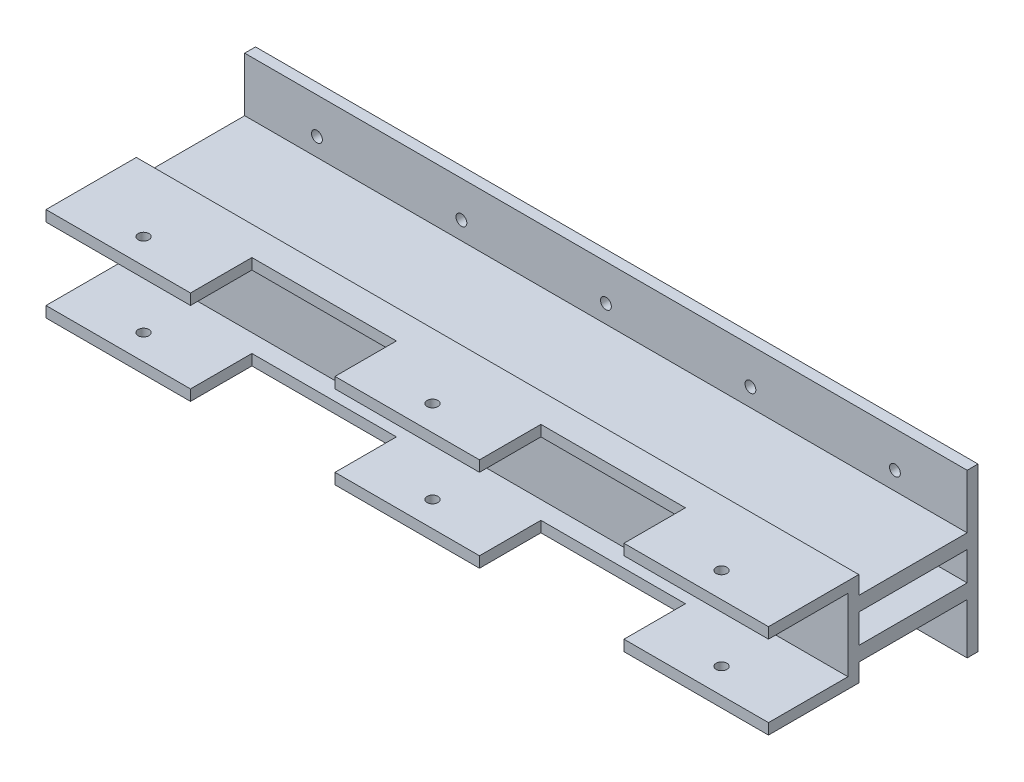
ISO-10303-21;
HEADER;
FILE_DESCRIPTION(('STEP AP214'),'2;1');
FILE_NAME('part.step','',(''),(''),'','','');
FILE_SCHEMA(('AUTOMOTIVE_DESIGN { 1 0 10303 214 1 1 1 1 }'));
ENDSEC;
DATA;
#1=APPLICATION_CONTEXT('core data for automotive mechanical design processes');
#2=APPLICATION_PROTOCOL_DEFINITION('international standard','automotive_design',2000,#1);
#3=PRODUCT_CONTEXT('',#1,'mechanical');
#4=PRODUCT('Part','Part','',(#3));
#5=PRODUCT_RELATED_PRODUCT_CATEGORY('part','',(#4));
#6=PRODUCT_DEFINITION_FORMATION('','',#4);
#7=PRODUCT_DEFINITION_CONTEXT('part definition',#1,'design');
#8=PRODUCT_DEFINITION('design','',#6,#7);
#9=PRODUCT_DEFINITION_SHAPE('','',#8);
#10=(LENGTH_UNIT() NAMED_UNIT(*) SI_UNIT(.MILLI.,.METRE.));
#11=(NAMED_UNIT(*) PLANE_ANGLE_UNIT() SI_UNIT($,.RADIAN.));
#12=(NAMED_UNIT(*) SI_UNIT($,.STERADIAN.) SOLID_ANGLE_UNIT());
#13=UNCERTAINTY_MEASURE_WITH_UNIT(LENGTH_MEASURE(1.E-05),#10,'distance_accuracy_value','');
#14=(GEOMETRIC_REPRESENTATION_CONTEXT(3) GLOBAL_UNCERTAINTY_ASSIGNED_CONTEXT((#13)) GLOBAL_UNIT_ASSIGNED_CONTEXT((#10,
#11,#12)) REPRESENTATION_CONTEXT('',''));
#15=CARTESIAN_POINT('',(0.,0.,0.));
#16=DIRECTION('',(0.,0.,1.));
#17=DIRECTION('',(1.,0.,0.));
#18=AXIS2_PLACEMENT_3D('',#15,#16,#17);
#19=CARTESIAN_POINT('',(100.,-32.,-45.5));
#20=DIRECTION('',(0.,1.,0.));
#21=DIRECTION('',(0.,0.,1.));
#22=AXIS2_PLACEMENT_3D('',#19,#20,#21);
#23=PLANE('',#22);
#24=DIRECTION('',(-1.,0.,0.));
#25=VECTOR('',#24,1.);
#26=CARTESIAN_POINT('',(100.,-32.,-42.5));
#27=LINE('',#26,#25);
#28=CARTESIAN_POINT('',(100.,-32.,-42.5));
#29=VERTEX_POINT('',#28);
#30=CARTESIAN_POINT('',(18.,-32.,-42.5));
#31=VERTEX_POINT('',#30);
#32=EDGE_CURVE('E482',#29,#31,#27,.T.);
#33=ORIENTED_EDGE('',*,*,#32,.T.);
#34=DIRECTION('',(0.,0.,-1.));
#35=VECTOR('',#34,1.);
#36=CARTESIAN_POINT('',(18.,-32.,-4.55266807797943));
#37=LINE('',#36,#35);
#38=CARTESIAN_POINT('',(18.,-32.,-45.5));
#39=VERTEX_POINT('',#38);
#40=EDGE_CURVE('E302',#31,#39,#37,.T.);
#41=ORIENTED_EDGE('',*,*,#40,.T.);
#42=DIRECTION('',(-1.,0.,0.));
#43=VECTOR('',#42,1.);
#44=CARTESIAN_POINT('',(100.,-32.,-45.5));
#45=LINE('',#44,#43);
#46=CARTESIAN_POINT('',(100.,-32.,-45.5));
#47=VERTEX_POINT('',#46);
#48=EDGE_CURVE('E487',#47,#39,#45,.T.);
#49=ORIENTED_EDGE('',*,*,#48,.F.);
#50=DIRECTION('',(0.,0.,1.));
#51=VECTOR('',#50,1.);
#52=CARTESIAN_POINT('',(100.,-32.,-45.5));
#53=LINE('',#52,#51);
#54=EDGE_CURVE('E506',#47,#29,#53,.T.);
#55=ORIENTED_EDGE('',*,*,#54,.T.);
#56=EDGE_LOOP('',(#33,#41,#49,#55));
#57=FACE_BOUND('',#56,.T.);
#58=ADVANCED_FACE('F39',(#57),#23,.F.);
#59=CARTESIAN_POINT('',(-100.,3.,12.5));
#60=DIRECTION('',(0.,0.,-1.));
#61=DIRECTION('',(-1.,0.,0.));
#62=AXIS2_PLACEMENT_3D('',#59,#60,#61);
#63=PLANE('',#62);
#64=DIRECTION('',(1.,0.,0.));
#65=VECTOR('',#64,1.);
#66=CARTESIAN_POINT('',(-100.,3.,12.5));
#67=LINE('',#66,#65);
#68=CARTESIAN_POINT('',(-20.,3.,12.5));
#69=VERTEX_POINT('',#68);
#70=CARTESIAN_POINT('',(20.,3.,12.5));
#71=VERTEX_POINT('',#70);
#72=EDGE_CURVE('E650',#69,#71,#67,.T.);
#73=ORIENTED_EDGE('',*,*,#72,.F.);
#74=DIRECTION('',(0.,1.,0.));
#75=VECTOR('',#74,1.);
#76=CARTESIAN_POINT('',(-20.,-66.4626276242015,12.5));
#77=LINE('',#76,#75);
#78=CARTESIAN_POINT('',(-20.,0.,12.5));
#79=VERTEX_POINT('',#78);
#80=EDGE_CURVE('E357',#79,#69,#77,.T.);
#81=ORIENTED_EDGE('',*,*,#80,.F.);
#82=DIRECTION('',(1.,0.,0.));
#83=VECTOR('',#82,1.);
#84=CARTESIAN_POINT('',(-100.,0.,12.5));
#85=LINE('',#84,#83);
#86=CARTESIAN_POINT('',(20.,0.,12.5));
#87=VERTEX_POINT('',#86);
#88=EDGE_CURVE('E658',#79,#87,#85,.T.);
#89=ORIENTED_EDGE('',*,*,#88,.T.);
#90=DIRECTION('',(0.,1.,0.));
#91=VECTOR('',#90,1.);
#92=CARTESIAN_POINT('',(20.,-66.4626276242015,12.5));
#93=LINE('',#92,#91);
#94=EDGE_CURVE('E373',#87,#71,#93,.T.);
#95=ORIENTED_EDGE('',*,*,#94,.T.);
#96=EDGE_LOOP('',(#73,#81,#89,#95));
#97=FACE_BOUND('',#96,.T.);
#98=ADVANCED_FACE('F794',(#97),#63,.F.);
#99=CARTESIAN_POINT('',(-100.,0.,12.5));
#100=VERTEX_POINT('',#99);
#101=CARTESIAN_POINT('',(-60.,0.,12.5));
#102=VERTEX_POINT('',#101);
#103=EDGE_CURVE('E641',#100,#102,#85,.T.);
#104=ORIENTED_EDGE('',*,*,#103,.T.);
#105=DIRECTION('',(0.,1.,0.));
#106=VECTOR('',#105,1.);
#107=CARTESIAN_POINT('',(-60.,-66.4626276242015,12.5));
#108=LINE('',#107,#106);
#109=CARTESIAN_POINT('',(-60.,3.,12.5));
#110=VERTEX_POINT('',#109);
#111=EDGE_CURVE('E347',#102,#110,#108,.T.);
#112=ORIENTED_EDGE('',*,*,#111,.T.);
#113=CARTESIAN_POINT('',(-100.,3.,12.5));
#114=VERTEX_POINT('',#113);
#115=EDGE_CURVE('E646',#114,#110,#67,.T.);
#116=ORIENTED_EDGE('',*,*,#115,.F.);
#117=DIRECTION('',(0.,-1.,0.));
#118=VECTOR('',#117,1.);
#119=CARTESIAN_POINT('',(-100.,3.,12.5));
#120=LINE('',#119,#118);
#121=EDGE_CURVE('E661',#114,#100,#120,.T.);
#122=ORIENTED_EDGE('',*,*,#121,.T.);
#123=EDGE_LOOP('',(#104,#112,#116,#122));
#124=FACE_BOUND('',#123,.T.);
#125=ADVANCED_FACE('F703',(#124),#63,.F.);
#126=CARTESIAN_POINT('',(-100.,-23.,12.5));
#127=DIRECTION('',(0.,0.,-1.));
#128=DIRECTION('',(-1.,0.,0.));
#129=AXIS2_PLACEMENT_3D('',#126,#127,#128);
#130=PLANE('',#129);
#131=DIRECTION('',(-1.,0.,0.));
#132=VECTOR('',#131,1.);
#133=CARTESIAN_POINT('',(-100.,-20.,12.5));
#134=LINE('',#133,#132);
#135=CARTESIAN_POINT('',(20.,-20.,12.5));
#136=VERTEX_POINT('',#135);
#137=CARTESIAN_POINT('',(-20.,-20.,12.5));
#138=VERTEX_POINT('',#137);
#139=EDGE_CURVE('E618',#136,#138,#134,.T.);
#140=ORIENTED_EDGE('',*,*,#139,.T.);
#141=CARTESIAN_POINT('',(-20.,-23.,12.5));
#142=VERTEX_POINT('',#141);
#143=EDGE_CURVE('E362',#142,#138,#77,.T.);
#144=ORIENTED_EDGE('',*,*,#143,.F.);
#145=DIRECTION('',(-1.,0.,0.));
#146=VECTOR('',#145,1.);
#147=CARTESIAN_POINT('',(-100.,-23.,12.5));
#148=LINE('',#147,#146);
#149=CARTESIAN_POINT('',(20.,-23.,12.5));
#150=VERTEX_POINT('',#149);
#151=EDGE_CURVE('E610',#150,#142,#148,.T.);
#152=ORIENTED_EDGE('',*,*,#151,.F.);
#153=EDGE_CURVE('E369',#150,#136,#93,.T.);
#154=ORIENTED_EDGE('',*,*,#153,.T.);
#155=EDGE_LOOP('',(#140,#144,#152,#154));
#156=FACE_BOUND('',#155,.T.);
#157=ADVANCED_FACE('F773',(#156),#130,.F.);
#158=CARTESIAN_POINT('',(-60.,-23.,12.5));
#159=VERTEX_POINT('',#158);
#160=CARTESIAN_POINT('',(-100.,-23.,12.5));
#161=VERTEX_POINT('',#160);
#162=EDGE_CURVE('E605',#159,#161,#148,.T.);
#163=ORIENTED_EDGE('',*,*,#162,.F.);
#164=CARTESIAN_POINT('',(-60.,-20.,12.5));
#165=VERTEX_POINT('',#164);
#166=EDGE_CURVE('E354',#159,#165,#108,.T.);
#167=ORIENTED_EDGE('',*,*,#166,.T.);
#168=CARTESIAN_POINT('',(-100.,-20.,12.5));
#169=VERTEX_POINT('',#168);
#170=EDGE_CURVE('E615',#165,#169,#134,.T.);
#171=ORIENTED_EDGE('',*,*,#170,.T.);
#172=DIRECTION('',(0.,1.,0.));
#173=VECTOR('',#172,1.);
#174=CARTESIAN_POINT('',(-100.,-23.,12.5));
#175=LINE('',#174,#173);
#176=EDGE_CURVE('E609',#161,#169,#175,.T.);
#177=ORIENTED_EDGE('',*,*,#176,.F.);
#178=EDGE_LOOP('',(#163,#167,#171,#177));
#179=FACE_BOUND('',#178,.T.);
#180=ADVANCED_FACE('F687',(#179),#130,.F.);
#181=CARTESIAN_POINT('',(-100.,3.,-12.5));
#182=DIRECTION('',(0.,0.,1.));
#183=DIRECTION('',(1.,0.,0.));
#184=AXIS2_PLACEMENT_3D('',#181,#182,#183);
#185=PLANE('',#184);
#186=DIRECTION('',(1.,0.,0.));
#187=VECTOR('',#186,1.);
#188=CARTESIAN_POINT('',(100.,-14.,-12.5));
#189=LINE('',#188,#187);
#190=CARTESIAN_POINT('',(-100.,-14.,-12.5));
#191=VERTEX_POINT('',#190);
#192=CARTESIAN_POINT('',(100.,-14.,-12.5));
#193=VERTEX_POINT('',#192);
#194=EDGE_CURVE('E527',#191,#193,#189,.T.);
#195=ORIENTED_EDGE('',*,*,#194,.F.);
#196=DIRECTION('',(0.,-1.,0.));
#197=VECTOR('',#196,1.);
#198=CARTESIAN_POINT('',(-100.,3.,-12.5));
#199=LINE('',#198,#197);
#200=CARTESIAN_POINT('',(-100.,-6.,-12.5));
#201=VERTEX_POINT('',#200);
#202=EDGE_CURVE('E666',#201,#191,#199,.T.);
#203=ORIENTED_EDGE('',*,*,#202,.F.);
#204=DIRECTION('',(-1.,0.,0.));
#205=VECTOR('',#204,1.);
#206=CARTESIAN_POINT('',(100.,-6.,-12.5));
#207=LINE('',#206,#205);
#208=CARTESIAN_POINT('',(100.,-6.,-12.5));
#209=VERTEX_POINT('',#208);
#210=EDGE_CURVE('E540',#209,#201,#207,.T.);
#211=ORIENTED_EDGE('',*,*,#210,.F.);
#212=DIRECTION('',(0.,-1.,0.));
#213=VECTOR('',#212,1.);
#214=CARTESIAN_POINT('',(100.,3.,-12.5));
#215=LINE('',#214,#213);
#216=EDGE_CURVE('E47',#209,#193,#215,.T.);
#217=ORIENTED_EDGE('',*,*,#216,.T.);
#218=EDGE_LOOP('',(#195,#203,#211,#217));
#219=FACE_BOUND('',#218,.T.);
#220=ADVANCED_FACE('F1014',(#219),#185,.F.);
#221=DIRECTION('',(-1.,0.,0.));
#222=VECTOR('',#221,1.);
#223=CARTESIAN_POINT('',(100.,-18.,-12.5));
#224=LINE('',#223,#222);
#225=CARTESIAN_POINT('',(100.,-18.,-12.5));
#226=VERTEX_POINT('',#225);
#227=CARTESIAN_POINT('',(-100.,-18.,-12.5));
#228=VERTEX_POINT('',#227);
#229=EDGE_CURVE('E524',#226,#228,#224,.T.);
#230=ORIENTED_EDGE('',*,*,#229,.F.);
#231=CARTESIAN_POINT('',(100.,-23.,-12.5));
#232=VERTEX_POINT('',#231);
#233=EDGE_CURVE('E48',#226,#232,#215,.T.);
#234=ORIENTED_EDGE('',*,*,#233,.T.);
#235=DIRECTION('',(1.,0.,0.));
#236=VECTOR('',#235,1.);
#237=CARTESIAN_POINT('',(-100.,-23.,-12.5));
#238=LINE('',#237,#236);
#239=CARTESIAN_POINT('',(-100.,-23.,-12.5));
#240=VERTEX_POINT('',#239);
#241=EDGE_CURVE('E599',#240,#232,#238,.T.);
#242=ORIENTED_EDGE('',*,*,#241,.F.);
#243=EDGE_CURVE('E663',#228,#240,#199,.T.);
#244=ORIENTED_EDGE('',*,*,#243,.F.);
#245=EDGE_LOOP('',(#230,#234,#242,#244));
#246=FACE_BOUND('',#245,.T.);
#247=ADVANCED_FACE('F678',(#246),#185,.F.);
#248=DIRECTION('',(1.,0.,0.));
#249=VECTOR('',#248,1.);
#250=CARTESIAN_POINT('',(100.,-2.,-12.5));
#251=LINE('',#250,#249);
#252=CARTESIAN_POINT('',(-100.,-2.,-12.5));
#253=VERTEX_POINT('',#252);
#254=CARTESIAN_POINT('',(100.,-2.,-12.5));
#255=VERTEX_POINT('',#254);
#256=EDGE_CURVE('E531',#253,#255,#251,.T.);
#257=ORIENTED_EDGE('',*,*,#256,.F.);
#258=CARTESIAN_POINT('',(-100.,3.,-12.5));
#259=VERTEX_POINT('',#258);
#260=EDGE_CURVE('E664',#259,#253,#199,.T.);
#261=ORIENTED_EDGE('',*,*,#260,.F.);
#262=DIRECTION('',(-1.,0.,0.));
#263=VECTOR('',#262,1.);
#264=CARTESIAN_POINT('',(-100.,3.,-12.5));
#265=LINE('',#264,#263);
#266=CARTESIAN_POINT('',(100.,3.,-12.5));
#267=VERTEX_POINT('',#266);
#268=EDGE_CURVE('E640',#267,#259,#265,.T.);
#269=ORIENTED_EDGE('',*,*,#268,.F.);
#270=EDGE_CURVE('E11',#267,#255,#215,.T.);
#271=ORIENTED_EDGE('',*,*,#270,.T.);
#272=EDGE_LOOP('',(#257,#261,#269,#271));
#273=FACE_BOUND('',#272,.T.);
#274=ADVANCED_FACE('F725',(#273),#185,.F.);
#275=CARTESIAN_POINT('',(100.,3.,12.5));
#276=DIRECTION('',(-1.,0.,0.));
#277=DIRECTION('',(0.,0.,1.));
#278=AXIS2_PLACEMENT_3D('',#275,#276,#277);
#279=PLANE('',#278);
#280=DIRECTION('',(0.,0.,1.));
#281=VECTOR('',#280,1.);
#282=CARTESIAN_POINT('',(100.,-6.,-42.5));
#283=LINE('',#282,#281);
#284=CARTESIAN_POINT('',(100.,-6.00000000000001,-42.5));
#285=VERTEX_POINT('',#284);
#286=EDGE_CURVE('E553',#285,#209,#283,.T.);
#287=ORIENTED_EDGE('',*,*,#286,.F.);
#288=DIRECTION('',(0.,-1.,0.));
#289=VECTOR('',#288,1.);
#290=CARTESIAN_POINT('',(100.,-32.,-42.5));
#291=LINE('',#290,#289);
#292=CARTESIAN_POINT('',(100.,-14.,-42.5));
#293=VERTEX_POINT('',#292);
#294=EDGE_CURVE('E502',#285,#293,#291,.T.);
#295=ORIENTED_EDGE('',*,*,#294,.T.);
#296=DIRECTION('',(0.,0.,1.));
#297=VECTOR('',#296,1.);
#298=CARTESIAN_POINT('',(100.,-14.,-42.5));
#299=LINE('',#298,#297);
#300=EDGE_CURVE('E515',#293,#193,#299,.T.);
#301=ORIENTED_EDGE('',*,*,#300,.T.);
#302=ORIENTED_EDGE('',*,*,#216,.F.);
#303=EDGE_LOOP('',(#287,#295,#301,#302));
#304=FACE_BOUND('',#303,.T.);
#305=DIRECTION('',(0.,0.,-1.));
#306=VECTOR('',#305,1.);
#307=CARTESIAN_POINT('',(100.,0.,12.5));
#308=LINE('',#307,#306);
#309=CARTESIAN_POINT('',(100.,0.,12.5));
#310=VERTEX_POINT('',#309);
#311=CARTESIAN_POINT('',(100.,0.,-9.5));
#312=VERTEX_POINT('',#311);
#313=EDGE_CURVE('E636',#310,#312,#308,.T.);
#314=ORIENTED_EDGE('',*,*,#313,.T.);
#315=DIRECTION('',(0.,1.,0.));
#316=VECTOR('',#315,1.);
#317=CARTESIAN_POINT('',(100.,-20.,-9.5));
#318=LINE('',#317,#316);
#319=CARTESIAN_POINT('',(100.,-20.,-9.5));
#320=VERTEX_POINT('',#319);
#321=EDGE_CURVE('E633',#320,#312,#318,.T.);
#322=ORIENTED_EDGE('',*,*,#321,.F.);
#323=DIRECTION('',(0.,0.,1.));
#324=VECTOR('',#323,1.);
#325=CARTESIAN_POINT('',(100.,-20.,12.5));
#326=LINE('',#325,#324);
#327=CARTESIAN_POINT('',(100.,-20.,12.5));
#328=VERTEX_POINT('',#327);
#329=EDGE_CURVE('E613',#320,#328,#326,.T.);
#330=ORIENTED_EDGE('',*,*,#329,.T.);
#331=DIRECTION('',(0.,1.,0.));
#332=VECTOR('',#331,1.);
#333=CARTESIAN_POINT('',(100.,-23.,12.5));
#334=LINE('',#333,#332);
#335=CARTESIAN_POINT('',(100.,-23.,12.5));
#336=VERTEX_POINT('',#335);
#337=EDGE_CURVE('E621',#336,#328,#334,.T.);
#338=ORIENTED_EDGE('',*,*,#337,.F.);
#339=DIRECTION('',(0.,0.,1.));
#340=VECTOR('',#339,1.);
#341=CARTESIAN_POINT('',(100.,-23.,12.5));
#342=LINE('',#341,#340);
#343=EDGE_CURVE('E603',#232,#336,#342,.T.);
#344=ORIENTED_EDGE('',*,*,#343,.F.);
#345=ORIENTED_EDGE('',*,*,#233,.F.);
#346=DIRECTION('',(0.,0.,1.));
#347=VECTOR('',#346,1.);
#348=CARTESIAN_POINT('',(100.,-18.,-42.5));
#349=LINE('',#348,#347);
#350=CARTESIAN_POINT('',(100.,-18.,-42.5));
#351=VERTEX_POINT('',#350);
#352=EDGE_CURVE('E517',#351,#226,#349,.T.);
#353=ORIENTED_EDGE('',*,*,#352,.F.);
#354=EDGE_CURVE('E497',#351,#29,#291,.T.);
#355=ORIENTED_EDGE('',*,*,#354,.T.);
#356=ORIENTED_EDGE('',*,*,#54,.F.);
#357=DIRECTION('',(0.,-1.,0.));
#358=VECTOR('',#357,1.);
#359=CARTESIAN_POINT('',(100.,-32.,-45.5));
#360=LINE('',#359,#358);
#361=CARTESIAN_POINT('',(100.,13.,-45.5));
#362=VERTEX_POINT('',#361);
#363=EDGE_CURVE('E484',#362,#47,#360,.T.);
#364=ORIENTED_EDGE('',*,*,#363,.F.);
#365=DIRECTION('',(0.,0.,1.));
#366=VECTOR('',#365,1.);
#367=CARTESIAN_POINT('',(100.,13.,-45.5));
#368=LINE('',#367,#366);
#369=CARTESIAN_POINT('',(100.,13.,-42.5));
#370=VERTEX_POINT('',#369);
#371=EDGE_CURVE('E509',#362,#370,#368,.T.);
#372=ORIENTED_EDGE('',*,*,#371,.T.);
#373=CARTESIAN_POINT('',(100.,-2.,-42.5));
#374=VERTEX_POINT('',#373);
#375=EDGE_CURVE('E498',#370,#374,#291,.T.);
#376=ORIENTED_EDGE('',*,*,#375,.T.);
#377=DIRECTION('',(0.,0.,1.));
#378=VECTOR('',#377,1.);
#379=CARTESIAN_POINT('',(100.,-2.,-42.5));
#380=LINE('',#379,#378);
#381=EDGE_CURVE('E556',#374,#255,#380,.T.);
#382=ORIENTED_EDGE('',*,*,#381,.T.);
#383=ORIENTED_EDGE('',*,*,#270,.F.);
#384=DIRECTION('',(0.,0.,-1.));
#385=VECTOR('',#384,1.);
#386=CARTESIAN_POINT('',(100.,3.,12.5));
#387=LINE('',#386,#385);
#388=CARTESIAN_POINT('',(100.,3.,12.5));
#389=VERTEX_POINT('',#388);
#390=EDGE_CURVE('E637',#389,#267,#387,.T.);
#391=ORIENTED_EDGE('',*,*,#390,.F.);
#392=DIRECTION('',(0.,-1.,0.));
#393=VECTOR('',#392,1.);
#394=CARTESIAN_POINT('',(100.,3.,12.5));
#395=LINE('',#394,#393);
#396=EDGE_CURVE('E649',#389,#310,#395,.T.);
#397=ORIENTED_EDGE('',*,*,#396,.T.);
#398=EDGE_LOOP('',(#314,#322,#330,#338,#344,#345,#353,#355,#356,#364,#372,#376,#382,#383,#391,#397));
#399=FACE_BOUND('',#398,.T.);
#400=ADVANCED_FACE('F41',(#304,#399),#279,.F.);
#401=CARTESIAN_POINT('',(-100.,3.,12.5));
#402=DIRECTION('',(1.,0.,0.));
#403=DIRECTION('',(0.,0.,-1.));
#404=AXIS2_PLACEMENT_3D('',#401,#402,#403);
#405=PLANE('',#404);
#406=DIRECTION('',(0.,0.,1.));
#407=VECTOR('',#406,1.);
#408=CARTESIAN_POINT('',(-100.,-2.,-42.5));
#409=LINE('',#408,#407);
#410=CARTESIAN_POINT('',(-100.,-2.,-42.5));
#411=VERTEX_POINT('',#410);
#412=EDGE_CURVE('E543',#411,#253,#409,.T.);
#413=ORIENTED_EDGE('',*,*,#412,.F.);
#414=DIRECTION('',(0.,1.,0.));
#415=VECTOR('',#414,1.);
#416=CARTESIAN_POINT('',(-100.,-32.,-42.5));
#417=LINE('',#416,#415);
#418=CARTESIAN_POINT('',(-100.,13.,-42.5));
#419=VERTEX_POINT('',#418);
#420=EDGE_CURVE('E475',#411,#419,#417,.T.);
#421=ORIENTED_EDGE('',*,*,#420,.T.);
#422=DIRECTION('',(0.,0.,1.));
#423=VECTOR('',#422,1.);
#424=CARTESIAN_POINT('',(-100.,13.,-45.5));
#425=LINE('',#424,#423);
#426=CARTESIAN_POINT('',(-100.,13.,-45.5));
#427=VERTEX_POINT('',#426);
#428=EDGE_CURVE('E512',#427,#419,#425,.T.);
#429=ORIENTED_EDGE('',*,*,#428,.F.);
#430=DIRECTION('',(0.,1.,0.));
#431=VECTOR('',#430,1.);
#432=CARTESIAN_POINT('',(-100.,-32.,-45.5));
#433=LINE('',#432,#431);
#434=CARTESIAN_POINT('',(-100.,-32.,-45.5));
#435=VERTEX_POINT('',#434);
#436=EDGE_CURVE('E478',#435,#427,#433,.T.);
#437=ORIENTED_EDGE('',*,*,#436,.F.);
#438=DIRECTION('',(0.,0.,1.));
#439=VECTOR('',#438,1.);
#440=CARTESIAN_POINT('',(-100.,-32.,-45.5));
#441=LINE('',#440,#439);
#442=CARTESIAN_POINT('',(-100.,-32.,-42.5));
#443=VERTEX_POINT('',#442);
#444=EDGE_CURVE('E490',#435,#443,#441,.T.);
#445=ORIENTED_EDGE('',*,*,#444,.T.);
#446=CARTESIAN_POINT('',(-100.,-18.,-42.5));
#447=VERTEX_POINT('',#446);
#448=EDGE_CURVE('E491',#443,#447,#417,.T.);
#449=ORIENTED_EDGE('',*,*,#448,.T.);
#450=DIRECTION('',(0.,0.,1.));
#451=VECTOR('',#450,1.);
#452=CARTESIAN_POINT('',(-100.,-18.,-42.5));
#453=LINE('',#452,#451);
#454=EDGE_CURVE('E519',#447,#228,#453,.T.);
#455=ORIENTED_EDGE('',*,*,#454,.T.);
#456=ORIENTED_EDGE('',*,*,#243,.T.);
#457=DIRECTION('',(0.,0.,-1.));
#458=VECTOR('',#457,1.);
#459=CARTESIAN_POINT('',(-100.,-23.,12.5));
#460=LINE('',#459,#458);
#461=EDGE_CURVE('E596',#161,#240,#460,.T.);
#462=ORIENTED_EDGE('',*,*,#461,.F.);
#463=ORIENTED_EDGE('',*,*,#176,.T.);
#464=DIRECTION('',(0.,0.,-1.));
#465=VECTOR('',#464,1.);
#466=CARTESIAN_POINT('',(-100.,-20.,12.5));
#467=LINE('',#466,#465);
#468=CARTESIAN_POINT('',(-100.,-20.,-9.5));
#469=VERTEX_POINT('',#468);
#470=EDGE_CURVE('E595',#169,#469,#467,.T.);
#471=ORIENTED_EDGE('',*,*,#470,.T.);
#472=DIRECTION('',(0.,1.,0.));
#473=VECTOR('',#472,1.);
#474=CARTESIAN_POINT('',(-100.,-20.,-9.5));
#475=LINE('',#474,#473);
#476=CARTESIAN_POINT('',(-100.,0.,-9.5));
#477=VERTEX_POINT('',#476);
#478=EDGE_CURVE('E628',#469,#477,#475,.T.);
#479=ORIENTED_EDGE('',*,*,#478,.T.);
#480=DIRECTION('',(0.,0.,1.));
#481=VECTOR('',#480,1.);
#482=CARTESIAN_POINT('',(-100.,0.,12.5));
#483=LINE('',#482,#481);
#484=EDGE_CURVE('E653',#477,#100,#483,.T.);
#485=ORIENTED_EDGE('',*,*,#484,.T.);
#486=ORIENTED_EDGE('',*,*,#121,.F.);
#487=DIRECTION('',(0.,0.,1.));
#488=VECTOR('',#487,1.);
#489=CARTESIAN_POINT('',(-100.,3.,12.5));
#490=LINE('',#489,#488);
#491=EDGE_CURVE('E643',#259,#114,#490,.T.);
#492=ORIENTED_EDGE('',*,*,#491,.F.);
#493=ORIENTED_EDGE('',*,*,#260,.T.);
#494=EDGE_LOOP('',(#413,#421,#429,#437,#445,#449,#455,#456,#462,#463,#471,#479,#485,#486,#492,#493));
#495=FACE_BOUND('',#494,.T.);
#496=CARTESIAN_POINT('',(-100.,-14.,-42.5));
#497=VERTEX_POINT('',#496);
#498=CARTESIAN_POINT('',(-100.,-6.,-42.5));
#499=VERTEX_POINT('',#498);
#500=EDGE_CURVE('E495',#497,#499,#417,.T.);
#501=ORIENTED_EDGE('',*,*,#500,.T.);
#502=DIRECTION('',(0.,0.,1.));
#503=VECTOR('',#502,1.);
#504=CARTESIAN_POINT('',(-100.,-6.,-42.5));
#505=LINE('',#504,#503);
#506=EDGE_CURVE('E550',#499,#201,#505,.T.);
#507=ORIENTED_EDGE('',*,*,#506,.T.);
#508=ORIENTED_EDGE('',*,*,#202,.T.);
#509=DIRECTION('',(0.,0.,1.));
#510=VECTOR('',#509,1.);
#511=CARTESIAN_POINT('',(-100.,-14.,-42.5));
#512=LINE('',#511,#510);
#513=EDGE_CURVE('E521',#497,#191,#512,.T.);
#514=ORIENTED_EDGE('',*,*,#513,.F.);
#515=EDGE_LOOP('',(#501,#507,#508,#514));
#516=FACE_BOUND('',#515,.T.);
#517=ADVANCED_FACE('F674',(#495,#516),#405,.F.);
#518=CARTESIAN_POINT('',(60.,3.,12.5));
#519=VERTEX_POINT('',#518);
#520=EDGE_CURVE('E645',#519,#389,#67,.T.);
#521=ORIENTED_EDGE('',*,*,#520,.F.);
#522=DIRECTION('',(0.,1.,0.));
#523=VECTOR('',#522,1.);
#524=CARTESIAN_POINT('',(60.,-66.4626276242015,12.5));
#525=LINE('',#524,#523);
#526=CARTESIAN_POINT('',(60.,0.,12.5));
#527=VERTEX_POINT('',#526);
#528=EDGE_CURVE('E376',#527,#519,#525,.T.);
#529=ORIENTED_EDGE('',*,*,#528,.F.);
#530=EDGE_CURVE('E655',#527,#310,#85,.T.);
#531=ORIENTED_EDGE('',*,*,#530,.T.);
#532=ORIENTED_EDGE('',*,*,#396,.F.);
#533=EDGE_LOOP('',(#521,#529,#531,#532));
#534=FACE_BOUND('',#533,.T.);
#535=ADVANCED_FACE('F803',(#534),#63,.F.);
#536=CARTESIAN_POINT('',(0.,3.,0.));
#537=DIRECTION('',(0.,-1.,0.));
#538=DIRECTION('',(0.,0.,-1.));
#539=AXIS2_PLACEMENT_3D('',#536,#537,#538);
#540=PLANE('',#539);
#541=DIRECTION('',(-1.,0.,0.));
#542=VECTOR('',#541,1.);
#543=CARTESIAN_POINT('',(-60.,3.,-4.5));
#544=LINE('',#543,#542);
#545=CARTESIAN_POINT('',(-20.,3.,-4.5));
#546=VERTEX_POINT('',#545);
#547=CARTESIAN_POINT('',(-60.,3.,-4.5));
#548=VERTEX_POINT('',#547);
#549=EDGE_CURVE('E334',#546,#548,#544,.T.);
#550=ORIENTED_EDGE('',*,*,#549,.F.);
#551=DIRECTION('',(0.,0.,-1.));
#552=VECTOR('',#551,1.);
#553=CARTESIAN_POINT('',(-20.,3.,-4.5));
#554=LINE('',#553,#552);
#555=EDGE_CURVE('E337',#69,#546,#554,.T.);
#556=ORIENTED_EDGE('',*,*,#555,.F.);
#557=ORIENTED_EDGE('',*,*,#72,.T.);
#558=DIRECTION('',(0.,0.,1.));
#559=VECTOR('',#558,1.);
#560=CARTESIAN_POINT('',(20.,3.,-4.5));
#561=LINE('',#560,#559);
#562=CARTESIAN_POINT('',(20.,3.,-4.5));
#563=VERTEX_POINT('',#562);
#564=EDGE_CURVE('E390',#563,#71,#561,.T.);
#565=ORIENTED_EDGE('',*,*,#564,.F.);
#566=DIRECTION('',(-1.,0.,0.));
#567=VECTOR('',#566,1.);
#568=CARTESIAN_POINT('',(60.,3.,-4.5));
#569=LINE('',#568,#567);
#570=CARTESIAN_POINT('',(60.,3.,-4.5));
#571=VERTEX_POINT('',#570);
#572=EDGE_CURVE('E340',#571,#563,#569,.T.);
#573=ORIENTED_EDGE('',*,*,#572,.F.);
#574=DIRECTION('',(0.,0.,-1.));
#575=VECTOR('',#574,1.);
#576=CARTESIAN_POINT('',(60.,3.,-4.5));
#577=LINE('',#576,#575);
#578=EDGE_CURVE('E388',#519,#571,#577,.T.);
#579=ORIENTED_EDGE('',*,*,#578,.F.);
#580=ORIENTED_EDGE('',*,*,#520,.T.);
#581=ORIENTED_EDGE('',*,*,#390,.T.);
#582=ORIENTED_EDGE('',*,*,#268,.T.);
#583=ORIENTED_EDGE('',*,*,#491,.T.);
#584=ORIENTED_EDGE('',*,*,#115,.T.);
#585=DIRECTION('',(0.,0.,1.));
#586=VECTOR('',#585,1.);
#587=CARTESIAN_POINT('',(-60.,3.,-4.5));
#588=LINE('',#587,#586);
#589=EDGE_CURVE('E331',#548,#110,#588,.T.);
#590=ORIENTED_EDGE('',*,*,#589,.F.);
#591=EDGE_LOOP('',(#550,#556,#557,#565,#573,#579,#580,#581,#582,#583,#584,#590));
#592=FACE_BOUND('',#591,.T.);
#593=CARTESIAN_POINT('',(-80.,3.,5.5));
#594=DIRECTION('',(0.,1.,0.));
#595=DIRECTION('',(0.,0.,1.));
#596=AXIS2_PLACEMENT_3D('',#593,#594,#595);
#597=CIRCLE('',#596,1.5);
#598=CARTESIAN_POINT('',(-80.,3.,7.));
#599=VERTEX_POINT('',#598);
#600=EDGE_CURVE('E560',#599,#599,#597,.T.);
#601=ORIENTED_EDGE('',*,*,#600,.F.);
#602=EDGE_LOOP('',(#601));
#603=FACE_BOUND('',#602,.T.);
#604=CARTESIAN_POINT('',(0.,3.,5.5));
#605=DIRECTION('',(0.,1.,0.));
#606=DIRECTION('',(0.,0.,1.));
#607=AXIS2_PLACEMENT_3D('',#604,#605,#606);
#608=CIRCLE('',#607,1.5);
#609=CARTESIAN_POINT('',(0.,3.,7.));
#610=VERTEX_POINT('',#609);
#611=EDGE_CURVE('E564',#610,#610,#608,.T.);
#612=ORIENTED_EDGE('',*,*,#611,.F.);
#613=EDGE_LOOP('',(#612));
#614=FACE_BOUND('',#613,.T.);
#615=CARTESIAN_POINT('',(80.,3.,5.5));
#616=DIRECTION('',(0.,1.,0.));
#617=DIRECTION('',(0.,0.,1.));
#618=AXIS2_PLACEMENT_3D('',#615,#616,#617);
#619=CIRCLE('',#618,1.5);
#620=CARTESIAN_POINT('',(80.,3.,7.));
#621=VERTEX_POINT('',#620);
#622=EDGE_CURVE('E571',#621,#621,#619,.T.);
#623=ORIENTED_EDGE('',*,*,#622,.F.);
#624=EDGE_LOOP('',(#623));
#625=FACE_BOUND('',#624,.T.);
#626=ADVANCED_FACE('F720',(#592,#603,#614,#625),#540,.F.);
#627=CARTESIAN_POINT('',(0.,0.,0.));
#628=DIRECTION('',(0.,-1.,0.));
#629=DIRECTION('',(0.,0.,-1.));
#630=AXIS2_PLACEMENT_3D('',#627,#628,#629);
#631=PLANE('',#630);
#632=DIRECTION('',(0.,0.,1.));
#633=VECTOR('',#632,1.);
#634=CARTESIAN_POINT('',(-20.,0.,0.));
#635=LINE('',#634,#633);
#636=CARTESIAN_POINT('',(-20.,0.,-4.5));
#637=VERTEX_POINT('',#636);
#638=EDGE_CURVE('E421',#637,#79,#635,.T.);
#639=ORIENTED_EDGE('',*,*,#638,.F.);
#640=DIRECTION('',(1.,0.,0.));
#641=VECTOR('',#640,1.);
#642=CARTESIAN_POINT('',(0.,0.,-4.5));
#643=LINE('',#642,#641);
#644=CARTESIAN_POINT('',(-60.,0.,-4.5));
#645=VERTEX_POINT('',#644);
#646=EDGE_CURVE('E416',#645,#637,#643,.T.);
#647=ORIENTED_EDGE('',*,*,#646,.F.);
#648=DIRECTION('',(0.,0.,-1.));
#649=VECTOR('',#648,1.);
#650=CARTESIAN_POINT('',(-60.,0.,0.));
#651=LINE('',#650,#649);
#652=EDGE_CURVE('E411',#102,#645,#651,.T.);
#653=ORIENTED_EDGE('',*,*,#652,.F.);
#654=ORIENTED_EDGE('',*,*,#103,.F.);
#655=ORIENTED_EDGE('',*,*,#484,.F.);
#656=DIRECTION('',(-1.,0.,0.));
#657=VECTOR('',#656,1.);
#658=CARTESIAN_POINT('',(-100.,0.,-9.5));
#659=LINE('',#658,#657);
#660=EDGE_CURVE('E624',#312,#477,#659,.T.);
#661=ORIENTED_EDGE('',*,*,#660,.F.);
#662=ORIENTED_EDGE('',*,*,#313,.F.);
#663=ORIENTED_EDGE('',*,*,#530,.F.);
#664=DIRECTION('',(0.,0.,1.));
#665=VECTOR('',#664,1.);
#666=CARTESIAN_POINT('',(60.,0.,0.));
#667=LINE('',#666,#665);
#668=CARTESIAN_POINT('',(60.,0.,-4.5));
#669=VERTEX_POINT('',#668);
#670=EDGE_CURVE('E401',#669,#527,#667,.T.);
#671=ORIENTED_EDGE('',*,*,#670,.F.);
#672=DIRECTION('',(1.,0.,0.));
#673=VECTOR('',#672,1.);
#674=CARTESIAN_POINT('',(0.,0.,-4.5));
#675=LINE('',#674,#673);
#676=CARTESIAN_POINT('',(20.,0.,-4.5));
#677=VERTEX_POINT('',#676);
#678=EDGE_CURVE('E396',#677,#669,#675,.T.);
#679=ORIENTED_EDGE('',*,*,#678,.F.);
#680=DIRECTION('',(0.,0.,-1.));
#681=VECTOR('',#680,1.);
#682=CARTESIAN_POINT('',(20.,0.,0.));
#683=LINE('',#682,#681);
#684=EDGE_CURVE('E406',#87,#677,#683,.T.);
#685=ORIENTED_EDGE('',*,*,#684,.F.);
#686=ORIENTED_EDGE('',*,*,#88,.F.);
#687=EDGE_LOOP('',(#639,#647,#653,#654,#655,#661,#662,#663,#671,#679,#685,#686));
#688=FACE_BOUND('',#687,.T.);
#689=CARTESIAN_POINT('',(-80.,0.,5.5));
#690=DIRECTION('',(0.,-1.,0.));
#691=DIRECTION('',(0.,0.,-1.));
#692=AXIS2_PLACEMENT_3D('',#689,#690,#691);
#693=CIRCLE('',#692,1.5);
#694=CARTESIAN_POINT('',(-80.,0.,4.));
#695=VERTEX_POINT('',#694);
#696=EDGE_CURVE('E592',#695,#695,#693,.T.);
#697=ORIENTED_EDGE('',*,*,#696,.F.);
#698=EDGE_LOOP('',(#697));
#699=FACE_BOUND('',#698,.T.);
#700=CARTESIAN_POINT('',(0.,0.,5.5));
#701=DIRECTION('',(0.,-1.,0.));
#702=DIRECTION('',(0.,0.,-1.));
#703=AXIS2_PLACEMENT_3D('',#700,#701,#702);
#704=CIRCLE('',#703,1.5);
#705=CARTESIAN_POINT('',(0.,0.,4.));
#706=VERTEX_POINT('',#705);
#707=EDGE_CURVE('E586',#706,#706,#704,.T.);
#708=ORIENTED_EDGE('',*,*,#707,.F.);
#709=EDGE_LOOP('',(#708));
#710=FACE_BOUND('',#709,.T.);
#711=CARTESIAN_POINT('',(80.,0.,5.5));
#712=DIRECTION('',(0.,-1.,0.));
#713=DIRECTION('',(0.,0.,-1.));
#714=AXIS2_PLACEMENT_3D('',#711,#712,#713);
#715=CIRCLE('',#714,1.5);
#716=CARTESIAN_POINT('',(80.,0.,4.));
#717=VERTEX_POINT('',#716);
#718=EDGE_CURVE('E580',#717,#717,#715,.T.);
#719=ORIENTED_EDGE('',*,*,#718,.F.);
#720=EDGE_LOOP('',(#719));
#721=FACE_BOUND('',#720,.T.);
#722=ADVANCED_FACE('F707',(#688,#699,#710,#721),#631,.T.);
#723=CARTESIAN_POINT('',(-100.,-20.,-9.5));
#724=DIRECTION('',(0.,0.,-1.));
#725=DIRECTION('',(-1.,0.,0.));
#726=AXIS2_PLACEMENT_3D('',#723,#724,#725);
#727=PLANE('',#726);
#728=ORIENTED_EDGE('',*,*,#660,.T.);
#729=ORIENTED_EDGE('',*,*,#478,.F.);
#730=DIRECTION('',(-1.,0.,0.));
#731=VECTOR('',#730,1.);
#732=CARTESIAN_POINT('',(-100.,-20.,-9.5));
#733=LINE('',#732,#731);
#734=EDGE_CURVE('E625',#320,#469,#733,.T.);
#735=ORIENTED_EDGE('',*,*,#734,.F.);
#736=ORIENTED_EDGE('',*,*,#321,.T.);
#737=EDGE_LOOP('',(#728,#729,#735,#736));
#738=FACE_BOUND('',#737,.T.);
#739=ADVANCED_FACE('F697',(#738),#727,.F.);
#740=CARTESIAN_POINT('',(0.,-20.,0.));
#741=DIRECTION('',(0.,-1.,0.));
#742=DIRECTION('',(0.,0.,-1.));
#743=AXIS2_PLACEMENT_3D('',#740,#741,#742);
#744=PLANE('',#743);
#745=DIRECTION('',(1.,0.,0.));
#746=VECTOR('',#745,1.);
#747=CARTESIAN_POINT('',(0.,-20.,-4.5));
#748=LINE('',#747,#746);
#749=CARTESIAN_POINT('',(-60.,-20.,-4.5));
#750=VERTEX_POINT('',#749);
#751=CARTESIAN_POINT('',(-20.,-20.,-4.5));
#752=VERTEX_POINT('',#751);
#753=EDGE_CURVE('E413',#750,#752,#748,.T.);
#754=ORIENTED_EDGE('',*,*,#753,.T.);
#755=DIRECTION('',(0.,0.,1.));
#756=VECTOR('',#755,1.);
#757=CARTESIAN_POINT('',(-20.,-20.,0.));
#758=LINE('',#757,#756);
#759=EDGE_CURVE('E418',#752,#138,#758,.T.);
#760=ORIENTED_EDGE('',*,*,#759,.T.);
#761=ORIENTED_EDGE('',*,*,#139,.F.);
#762=DIRECTION('',(0.,0.,-1.));
#763=VECTOR('',#762,1.);
#764=CARTESIAN_POINT('',(20.,-20.,0.));
#765=LINE('',#764,#763);
#766=CARTESIAN_POINT('',(20.,-20.,-4.5));
#767=VERTEX_POINT('',#766);
#768=EDGE_CURVE('E403',#136,#767,#765,.T.);
#769=ORIENTED_EDGE('',*,*,#768,.T.);
#770=DIRECTION('',(1.,0.,0.));
#771=VECTOR('',#770,1.);
#772=CARTESIAN_POINT('',(0.,-20.,-4.5));
#773=LINE('',#772,#771);
#774=CARTESIAN_POINT('',(60.,-20.,-4.5));
#775=VERTEX_POINT('',#774);
#776=EDGE_CURVE('E364',#767,#775,#773,.T.);
#777=ORIENTED_EDGE('',*,*,#776,.T.);
#778=DIRECTION('',(0.,0.,1.));
#779=VECTOR('',#778,1.);
#780=CARTESIAN_POINT('',(60.,-20.,0.));
#781=LINE('',#780,#779);
#782=CARTESIAN_POINT('',(60.,-20.,12.5));
#783=VERTEX_POINT('',#782);
#784=EDGE_CURVE('E398',#775,#783,#781,.T.);
#785=ORIENTED_EDGE('',*,*,#784,.T.);
#786=EDGE_CURVE('E600',#328,#783,#134,.T.);
#787=ORIENTED_EDGE('',*,*,#786,.F.);
#788=ORIENTED_EDGE('',*,*,#329,.F.);
#789=ORIENTED_EDGE('',*,*,#734,.T.);
#790=ORIENTED_EDGE('',*,*,#470,.F.);
#791=ORIENTED_EDGE('',*,*,#170,.F.);
#792=DIRECTION('',(0.,0.,-1.));
#793=VECTOR('',#792,1.);
#794=CARTESIAN_POINT('',(-60.,-20.,0.));
#795=LINE('',#794,#793);
#796=EDGE_CURVE('E408',#165,#750,#795,.T.);
#797=ORIENTED_EDGE('',*,*,#796,.T.);
#798=EDGE_LOOP('',(#754,#760,#761,#769,#777,#785,#787,#788,#789,#790,#791,#797));
#799=FACE_BOUND('',#798,.T.);
#800=CARTESIAN_POINT('',(-80.,-20.,5.5));
#801=DIRECTION('',(0.,-1.,0.));
#802=DIRECTION('',(0.,0.,-1.));
#803=AXIS2_PLACEMENT_3D('',#800,#801,#802);
#804=CIRCLE('',#803,1.5);
#805=CARTESIAN_POINT('',(-80.,-20.,4.));
#806=VERTEX_POINT('',#805);
#807=EDGE_CURVE('E589',#806,#806,#804,.T.);
#808=ORIENTED_EDGE('',*,*,#807,.T.);
#809=EDGE_LOOP('',(#808));
#810=FACE_BOUND('',#809,.T.);
#811=CARTESIAN_POINT('',(0.,-20.,5.5));
#812=DIRECTION('',(0.,-1.,0.));
#813=DIRECTION('',(0.,0.,-1.));
#814=AXIS2_PLACEMENT_3D('',#811,#812,#813);
#815=CIRCLE('',#814,1.5);
#816=CARTESIAN_POINT('',(0.,-20.,4.));
#817=VERTEX_POINT('',#816);
#818=EDGE_CURVE('E583',#817,#817,#815,.T.);
#819=ORIENTED_EDGE('',*,*,#818,.T.);
#820=EDGE_LOOP('',(#819));
#821=FACE_BOUND('',#820,.T.);
#822=CARTESIAN_POINT('',(80.,-20.,5.5));
#823=DIRECTION('',(0.,-1.,0.));
#824=DIRECTION('',(0.,0.,-1.));
#825=AXIS2_PLACEMENT_3D('',#822,#823,#824);
#826=CIRCLE('',#825,1.5);
#827=CARTESIAN_POINT('',(80.,-20.,4.));
#828=VERTEX_POINT('',#827);
#829=EDGE_CURVE('E567',#828,#828,#826,.T.);
#830=ORIENTED_EDGE('',*,*,#829,.T.);
#831=EDGE_LOOP('',(#830));
#832=FACE_BOUND('',#831,.T.);
#833=ADVANCED_FACE('F691',(#799,#810,#821,#832),#744,.F.);
#834=ORIENTED_EDGE('',*,*,#786,.T.);
#835=CARTESIAN_POINT('',(60.,-23.,12.5));
#836=VERTEX_POINT('',#835);
#837=EDGE_CURVE('E374',#836,#783,#525,.T.);
#838=ORIENTED_EDGE('',*,*,#837,.F.);
#839=EDGE_CURVE('E606',#336,#836,#148,.T.);
#840=ORIENTED_EDGE('',*,*,#839,.F.);
#841=ORIENTED_EDGE('',*,*,#337,.T.);
#842=EDGE_LOOP('',(#834,#838,#840,#841));
#843=FACE_BOUND('',#842,.T.);
#844=ADVANCED_FACE('F758',(#843),#130,.F.);
#845=CARTESIAN_POINT('',(0.,-23.,0.));
#846=DIRECTION('',(0.,-1.,0.));
#847=DIRECTION('',(0.,0.,-1.));
#848=AXIS2_PLACEMENT_3D('',#845,#846,#847);
#849=PLANE('',#848);
#850=DIRECTION('',(0.,0.,-1.));
#851=VECTOR('',#850,1.);
#852=CARTESIAN_POINT('',(-20.,-23.,-4.5));
#853=LINE('',#852,#851);
#854=CARTESIAN_POINT('',(-20.,-23.,-4.5));
#855=VERTEX_POINT('',#854);
#856=EDGE_CURVE('E333',#142,#855,#853,.T.);
#857=ORIENTED_EDGE('',*,*,#856,.T.);
#858=DIRECTION('',(-1.,0.,0.));
#859=VECTOR('',#858,1.);
#860=CARTESIAN_POINT('',(-60.,-23.,-4.5));
#861=LINE('',#860,#859);
#862=CARTESIAN_POINT('',(-60.,-23.,-4.5));
#863=VERTEX_POINT('',#862);
#864=EDGE_CURVE('E349',#855,#863,#861,.T.);
#865=ORIENTED_EDGE('',*,*,#864,.T.);
#866=DIRECTION('',(0.,0.,1.));
#867=VECTOR('',#866,1.);
#868=CARTESIAN_POINT('',(-60.,-23.,-4.5));
#869=LINE('',#868,#867);
#870=EDGE_CURVE('E344',#863,#159,#869,.T.);
#871=ORIENTED_EDGE('',*,*,#870,.T.);
#872=ORIENTED_EDGE('',*,*,#162,.T.);
#873=ORIENTED_EDGE('',*,*,#461,.T.);
#874=ORIENTED_EDGE('',*,*,#241,.T.);
#875=ORIENTED_EDGE('',*,*,#343,.T.);
#876=ORIENTED_EDGE('',*,*,#839,.T.);
#877=DIRECTION('',(0.,0.,-1.));
#878=VECTOR('',#877,1.);
#879=CARTESIAN_POINT('',(60.,-23.,-4.5));
#880=LINE('',#879,#878);
#881=CARTESIAN_POINT('',(60.,-23.,-4.5));
#882=VERTEX_POINT('',#881);
#883=EDGE_CURVE('E380',#836,#882,#880,.T.);
#884=ORIENTED_EDGE('',*,*,#883,.T.);
#885=DIRECTION('',(-1.,0.,0.));
#886=VECTOR('',#885,1.);
#887=CARTESIAN_POINT('',(60.,-23.,-4.5));
#888=LINE('',#887,#886);
#889=CARTESIAN_POINT('',(20.,-23.,-4.5));
#890=VERTEX_POINT('',#889);
#891=EDGE_CURVE('E368',#882,#890,#888,.T.);
#892=ORIENTED_EDGE('',*,*,#891,.T.);
#893=DIRECTION('',(0.,0.,1.));
#894=VECTOR('',#893,1.);
#895=CARTESIAN_POINT('',(20.,-23.,-4.5));
#896=LINE('',#895,#894);
#897=EDGE_CURVE('E372',#890,#150,#896,.T.);
#898=ORIENTED_EDGE('',*,*,#897,.T.);
#899=ORIENTED_EDGE('',*,*,#151,.T.);
#900=EDGE_LOOP('',(#857,#865,#871,#872,#873,#874,#875,#876,#884,#892,#898,#899));
#901=FACE_BOUND('',#900,.T.);
#902=CARTESIAN_POINT('',(-80.,-23.,5.5));
#903=DIRECTION('',(0.,-1.,0.));
#904=DIRECTION('',(0.,0.,-1.));
#905=AXIS2_PLACEMENT_3D('',#902,#903,#904);
#906=CIRCLE('',#905,1.5);
#907=CARTESIAN_POINT('',(-80.,-23.,4.));
#908=VERTEX_POINT('',#907);
#909=EDGE_CURVE('E563',#908,#908,#906,.F.);
#910=ORIENTED_EDGE('',*,*,#909,.T.);
#911=EDGE_LOOP('',(#910));
#912=FACE_BOUND('',#911,.T.);
#913=CARTESIAN_POINT('',(0.,-23.,5.5));
#914=DIRECTION('',(0.,-1.,0.));
#915=DIRECTION('',(0.,0.,-1.));
#916=AXIS2_PLACEMENT_3D('',#913,#914,#915);
#917=CIRCLE('',#916,1.5);
#918=CARTESIAN_POINT('',(0.,-23.,4.));
#919=VERTEX_POINT('',#918);
#920=EDGE_CURVE('E568',#919,#919,#917,.F.);
#921=ORIENTED_EDGE('',*,*,#920,.T.);
#922=EDGE_LOOP('',(#921));
#923=FACE_BOUND('',#922,.T.);
#924=CARTESIAN_POINT('',(80.,-23.,5.5));
#925=DIRECTION('',(0.,-1.,0.));
#926=DIRECTION('',(0.,0.,-1.));
#927=AXIS2_PLACEMENT_3D('',#924,#925,#926);
#928=CIRCLE('',#927,1.5);
#929=CARTESIAN_POINT('',(80.,-23.,4.));
#930=VERTEX_POINT('',#929);
#931=EDGE_CURVE('E559',#930,#930,#928,.F.);
#932=ORIENTED_EDGE('',*,*,#931,.T.);
#933=EDGE_LOOP('',(#932));
#934=FACE_BOUND('',#933,.T.);
#935=ADVANCED_FACE('F682',(#901,#912,#923,#934),#849,.T.);
#936=CARTESIAN_POINT('',(80.,-27.2426406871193,5.5));
#937=DIRECTION('',(0.,1.,0.));
#938=DIRECTION('',(0.,0.,1.));
#939=AXIS2_PLACEMENT_3D('',#936,#937,#938);
#940=CYLINDRICAL_SURFACE('',#939,1.5);
#941=ORIENTED_EDGE('',*,*,#931,.F.);
#942=EDGE_LOOP('',(#941));
#943=FACE_BOUND('',#942,.T.);
#944=ORIENTED_EDGE('',*,*,#829,.F.);
#945=EDGE_LOOP('',(#944));
#946=FACE_BOUND('',#945,.T.);
#947=ADVANCED_FACE('F1069',(#943,#946),#940,.F.);
#948=CARTESIAN_POINT('',(0.,-27.2426406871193,5.5));
#949=DIRECTION('',(0.,1.,0.));
#950=DIRECTION('',(0.,0.,1.));
#951=AXIS2_PLACEMENT_3D('',#948,#949,#950);
#952=CYLINDRICAL_SURFACE('',#951,1.5);
#953=ORIENTED_EDGE('',*,*,#920,.F.);
#954=EDGE_LOOP('',(#953));
#955=FACE_BOUND('',#954,.T.);
#956=ORIENTED_EDGE('',*,*,#818,.F.);
#957=EDGE_LOOP('',(#956));
#958=FACE_BOUND('',#957,.T.);
#959=ADVANCED_FACE('F1311',(#955,#958),#952,.F.);
#960=CARTESIAN_POINT('',(-80.,-27.2426406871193,5.5));
#961=DIRECTION('',(0.,1.,0.));
#962=DIRECTION('',(0.,0.,1.));
#963=AXIS2_PLACEMENT_3D('',#960,#961,#962);
#964=CYLINDRICAL_SURFACE('',#963,1.5);
#965=ORIENTED_EDGE('',*,*,#909,.F.);
#966=EDGE_LOOP('',(#965));
#967=FACE_BOUND('',#966,.T.);
#968=ORIENTED_EDGE('',*,*,#807,.F.);
#969=EDGE_LOOP('',(#968));
#970=FACE_BOUND('',#969,.T.);
#971=ADVANCED_FACE('F1299',(#967,#970),#964,.F.);
#972=ORIENTED_EDGE('',*,*,#718,.T.);
#973=EDGE_LOOP('',(#972));
#974=FACE_BOUND('',#973,.T.);
#975=ORIENTED_EDGE('',*,*,#622,.T.);
#976=EDGE_LOOP('',(#975));
#977=FACE_BOUND('',#976,.T.);
#978=ADVANCED_FACE('F1308',(#974,#977),#940,.F.);
#979=ORIENTED_EDGE('',*,*,#707,.T.);
#980=EDGE_LOOP('',(#979));
#981=FACE_BOUND('',#980,.T.);
#982=ORIENTED_EDGE('',*,*,#611,.T.);
#983=EDGE_LOOP('',(#982));
#984=FACE_BOUND('',#983,.T.);
#985=ADVANCED_FACE('F1296',(#981,#984),#952,.F.);
#986=ORIENTED_EDGE('',*,*,#696,.T.);
#987=EDGE_LOOP('',(#986));
#988=FACE_BOUND('',#987,.T.);
#989=ORIENTED_EDGE('',*,*,#600,.T.);
#990=EDGE_LOOP('',(#989));
#991=FACE_BOUND('',#990,.T.);
#992=ADVANCED_FACE('F1260',(#988,#991),#964,.F.);
#993=CARTESIAN_POINT('',(100.,-2.,-42.5));
#994=DIRECTION('',(0.,-1.,0.));
#995=DIRECTION('',(0.,0.,-1.));
#996=AXIS2_PLACEMENT_3D('',#993,#994,#995);
#997=PLANE('',#996);
#998=ORIENTED_EDGE('',*,*,#256,.T.);
#999=ORIENTED_EDGE('',*,*,#381,.F.);
#1000=DIRECTION('',(1.,0.,0.));
#1001=VECTOR('',#1000,1.);
#1002=CARTESIAN_POINT('',(100.,-2.,-42.5));
#1003=LINE('',#1002,#1001);
#1004=EDGE_CURVE('E536',#411,#374,#1003,.T.);
#1005=ORIENTED_EDGE('',*,*,#1004,.F.);
#1006=ORIENTED_EDGE('',*,*,#412,.T.);
#1007=EDGE_LOOP('',(#998,#999,#1005,#1006));
#1008=FACE_BOUND('',#1007,.T.);
#1009=ADVANCED_FACE('F727',(#1008),#997,.F.);
#1010=CARTESIAN_POINT('',(100.,-6.,-42.5));
#1011=DIRECTION('',(0.,1.,0.));
#1012=DIRECTION('',(0.,0.,1.));
#1013=AXIS2_PLACEMENT_3D('',#1010,#1011,#1012);
#1014=PLANE('',#1013);
#1015=ORIENTED_EDGE('',*,*,#210,.T.);
#1016=ORIENTED_EDGE('',*,*,#506,.F.);
#1017=DIRECTION('',(-1.,0.,0.));
#1018=VECTOR('',#1017,1.);
#1019=CARTESIAN_POINT('',(100.,-6.,-42.5));
#1020=LINE('',#1019,#1018);
#1021=EDGE_CURVE('E539',#285,#499,#1020,.T.);
#1022=ORIENTED_EDGE('',*,*,#1021,.F.);
#1023=ORIENTED_EDGE('',*,*,#286,.T.);
#1024=EDGE_LOOP('',(#1015,#1016,#1022,#1023));
#1025=FACE_BOUND('',#1024,.T.);
#1026=ADVANCED_FACE('F1241',(#1025),#1014,.F.);
#1027=CARTESIAN_POINT('',(100.,-14.,-42.5));
#1028=DIRECTION('',(0.,-1.,0.));
#1029=DIRECTION('',(0.,0.,-1.));
#1030=AXIS2_PLACEMENT_3D('',#1027,#1028,#1029);
#1031=PLANE('',#1030);
#1032=ORIENTED_EDGE('',*,*,#194,.T.);
#1033=ORIENTED_EDGE('',*,*,#300,.F.);
#1034=DIRECTION('',(1.,0.,0.));
#1035=VECTOR('',#1034,1.);
#1036=CARTESIAN_POINT('',(100.,-14.,-42.5));
#1037=LINE('',#1036,#1035);
#1038=EDGE_CURVE('E528',#497,#293,#1037,.T.);
#1039=ORIENTED_EDGE('',*,*,#1038,.F.);
#1040=ORIENTED_EDGE('',*,*,#513,.T.);
#1041=EDGE_LOOP('',(#1032,#1033,#1039,#1040));
#1042=FACE_BOUND('',#1041,.T.);
#1043=ADVANCED_FACE('F899',(#1042),#1031,.F.);
#1044=CARTESIAN_POINT('',(100.,-18.,-42.5));
#1045=DIRECTION('',(0.,1.,0.));
#1046=DIRECTION('',(-1.,0.,0.));
#1047=AXIS2_PLACEMENT_3D('',#1044,#1045,#1046);
#1048=PLANE('',#1047);
#1049=ORIENTED_EDGE('',*,*,#229,.T.);
#1050=ORIENTED_EDGE('',*,*,#454,.F.);
#1051=DIRECTION('',(-1.,0.,0.));
#1052=VECTOR('',#1051,1.);
#1053=CARTESIAN_POINT('',(100.,-18.,-42.5));
#1054=LINE('',#1053,#1052);
#1055=EDGE_CURVE('E523',#351,#447,#1054,.T.);
#1056=ORIENTED_EDGE('',*,*,#1055,.F.);
#1057=ORIENTED_EDGE('',*,*,#352,.T.);
#1058=EDGE_LOOP('',(#1049,#1050,#1056,#1057));
#1059=FACE_BOUND('',#1058,.T.);
#1060=ADVANCED_FACE('F751',(#1059),#1048,.F.);
#1061=CARTESIAN_POINT('',(0.,0.,-42.5));
#1062=DIRECTION('',(0.,0.,1.));
#1063=DIRECTION('',(1.,0.,0.));
#1064=AXIS2_PLACEMENT_3D('',#1061,#1062,#1063);
#1065=PLANE('',#1064);
#1066=CARTESIAN_POINT('',(-80.,3.,-42.5));
#1067=DIRECTION('',(0.,0.,-1.));
#1068=DIRECTION('',(-1.,0.,0.));
#1069=AXIS2_PLACEMENT_3D('',#1066,#1067,#1068);
#1070=CIRCLE('',#1069,1.5);
#1071=CARTESIAN_POINT('',(-81.5,3.,-42.5));
#1072=VERTEX_POINT('',#1071);
#1073=EDGE_CURVE('E427',#1072,#1072,#1070,.T.);
#1074=ORIENTED_EDGE('',*,*,#1073,.T.);
#1075=EDGE_LOOP('',(#1074));
#1076=FACE_BOUND('',#1075,.T.);
#1077=CARTESIAN_POINT('',(-40.,3.,-42.5));
#1078=DIRECTION('',(0.,0.,-1.));
#1079=DIRECTION('',(-1.,0.,0.));
#1080=AXIS2_PLACEMENT_3D('',#1077,#1078,#1079);
#1081=CIRCLE('',#1080,1.5);
#1082=CARTESIAN_POINT('',(-41.5,3.,-42.5));
#1083=VERTEX_POINT('',#1082);
#1084=EDGE_CURVE('E439',#1083,#1083,#1081,.T.);
#1085=ORIENTED_EDGE('',*,*,#1084,.T.);
#1086=EDGE_LOOP('',(#1085));
#1087=FACE_BOUND('',#1086,.T.);
#1088=CARTESIAN_POINT('',(0.,3.,-42.5));
#1089=DIRECTION('',(0.,0.,-1.));
#1090=DIRECTION('',(-1.,0.,0.));
#1091=AXIS2_PLACEMENT_3D('',#1088,#1089,#1090);
#1092=CIRCLE('',#1091,1.5);
#1093=CARTESIAN_POINT('',(-1.50000000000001,3.,-42.5));
#1094=VERTEX_POINT('',#1093);
#1095=EDGE_CURVE('E445',#1094,#1094,#1092,.T.);
#1096=ORIENTED_EDGE('',*,*,#1095,.T.);
#1097=EDGE_LOOP('',(#1096));
#1098=FACE_BOUND('',#1097,.T.);
#1099=CARTESIAN_POINT('',(80.,3.,-42.5));
#1100=DIRECTION('',(0.,0.,-1.));
#1101=DIRECTION('',(-1.,0.,0.));
#1102=AXIS2_PLACEMENT_3D('',#1099,#1100,#1101);
#1103=CIRCLE('',#1102,1.5);
#1104=CARTESIAN_POINT('',(78.5,3.,-42.5));
#1105=VERTEX_POINT('',#1104);
#1106=EDGE_CURVE('E469',#1105,#1105,#1103,.T.);
#1107=ORIENTED_EDGE('',*,*,#1106,.T.);
#1108=EDGE_LOOP('',(#1107));
#1109=FACE_BOUND('',#1108,.T.);
#1110=CARTESIAN_POINT('',(40.,3.,-42.5));
#1111=DIRECTION('',(0.,0.,-1.));
#1112=DIRECTION('',(-1.,0.,0.));
#1113=AXIS2_PLACEMENT_3D('',#1110,#1111,#1112);
#1114=CIRCLE('',#1113,1.5);
#1115=CARTESIAN_POINT('',(38.5,3.,-42.5));
#1116=VERTEX_POINT('',#1115);
#1117=EDGE_CURVE('E463',#1116,#1116,#1114,.T.);
#1118=ORIENTED_EDGE('',*,*,#1117,.T.);
#1119=EDGE_LOOP('',(#1118));
#1120=FACE_BOUND('',#1119,.T.);
#1121=ORIENTED_EDGE('',*,*,#1004,.T.);
#1122=ORIENTED_EDGE('',*,*,#375,.F.);
#1123=DIRECTION('',(1.,0.,0.));
#1124=VECTOR('',#1123,1.);
#1125=CARTESIAN_POINT('',(100.,13.,-42.5));
#1126=LINE('',#1125,#1124);
#1127=EDGE_CURVE('E494',#419,#370,#1126,.T.);
#1128=ORIENTED_EDGE('',*,*,#1127,.F.);
#1129=ORIENTED_EDGE('',*,*,#420,.F.);
#1130=EDGE_LOOP('',(#1121,#1122,#1128,#1129));
#1131=FACE_BOUND('',#1130,.T.);
#1132=ADVANCED_FACE('F735',(#1076,#1087,#1098,#1109,#1120,#1131),#1065,.T.);
#1133=ORIENTED_EDGE('',*,*,#1021,.T.);
#1134=ORIENTED_EDGE('',*,*,#500,.F.);
#1135=ORIENTED_EDGE('',*,*,#1038,.T.);
#1136=ORIENTED_EDGE('',*,*,#294,.F.);
#1137=EDGE_LOOP('',(#1133,#1134,#1135,#1136));
#1138=FACE_BOUND('',#1137,.T.);
#1139=ADVANCED_FACE('F892',(#1138),#1065,.T.);
#1140=DIRECTION('',(0.,-1.,0.));
#1141=VECTOR('',#1140,1.);
#1142=CARTESIAN_POINT('',(18.,-20.,-42.5));
#1143=LINE('',#1142,#1141);
#1144=CARTESIAN_POINT('',(18.,-20.,-42.5));
#1145=VERTEX_POINT('',#1144);
#1146=EDGE_CURVE('E296',#1145,#31,#1143,.T.);
#1147=ORIENTED_EDGE('',*,*,#1146,.T.);
#1148=ORIENTED_EDGE('',*,*,#32,.F.);
#1149=ORIENTED_EDGE('',*,*,#354,.F.);
#1150=ORIENTED_EDGE('',*,*,#1055,.T.);
#1151=ORIENTED_EDGE('',*,*,#448,.F.);
#1152=CARTESIAN_POINT('',(-18.,-32.,-42.5));
#1153=VERTEX_POINT('',#1152);
#1154=EDGE_CURVE('E501',#1153,#443,#27,.T.);
#1155=ORIENTED_EDGE('',*,*,#1154,.F.);
#1156=DIRECTION('',(0.,1.,0.));
#1157=VECTOR('',#1156,1.);
#1158=CARTESIAN_POINT('',(-18.,-32.,-42.5));
#1159=LINE('',#1158,#1157);
#1160=CARTESIAN_POINT('',(-18.,-20.,-42.5));
#1161=VERTEX_POINT('',#1160);
#1162=EDGE_CURVE('E55',#1153,#1161,#1159,.T.);
#1163=ORIENTED_EDGE('',*,*,#1162,.T.);
#1164=DIRECTION('',(1.,0.,0.));
#1165=VECTOR('',#1164,1.);
#1166=CARTESIAN_POINT('',(0.,-20.,-42.5));
#1167=LINE('',#1166,#1165);
#1168=EDGE_CURVE('E310',#1161,#1145,#1167,.T.);
#1169=ORIENTED_EDGE('',*,*,#1168,.T.);
#1170=EDGE_LOOP('',(#1147,#1148,#1149,#1150,#1151,#1155,#1163,#1169));
#1171=FACE_BOUND('',#1170,.T.);
#1172=CARTESIAN_POINT('',(-80.,-23.,-42.5));
#1173=DIRECTION('',(0.,0.,-1.));
#1174=DIRECTION('',(-1.,0.,0.));
#1175=AXIS2_PLACEMENT_3D('',#1172,#1173,#1174);
#1176=CIRCLE('',#1175,1.5);
#1177=CARTESIAN_POINT('',(-81.5,-23.,-42.5));
#1178=VERTEX_POINT('',#1177);
#1179=EDGE_CURVE('E423',#1178,#1178,#1176,.T.);
#1180=ORIENTED_EDGE('',*,*,#1179,.T.);
#1181=EDGE_LOOP('',(#1180));
#1182=FACE_BOUND('',#1181,.T.);
#1183=CARTESIAN_POINT('',(-40.,-23.,-42.5));
#1184=DIRECTION('',(0.,0.,-1.));
#1185=DIRECTION('',(-1.,0.,0.));
#1186=AXIS2_PLACEMENT_3D('',#1183,#1184,#1185);
#1187=CIRCLE('',#1186,1.5);
#1188=CARTESIAN_POINT('',(-41.5,-23.,-42.5));
#1189=VERTEX_POINT('',#1188);
#1190=EDGE_CURVE('E433',#1189,#1189,#1187,.T.);
#1191=ORIENTED_EDGE('',*,*,#1190,.T.);
#1192=EDGE_LOOP('',(#1191));
#1193=FACE_BOUND('',#1192,.T.);
#1194=CARTESIAN_POINT('',(40.,-23.,-42.5));
#1195=DIRECTION('',(0.,0.,-1.));
#1196=DIRECTION('',(-1.,0.,0.));
#1197=AXIS2_PLACEMENT_3D('',#1194,#1195,#1196);
#1198=CIRCLE('',#1197,1.5);
#1199=CARTESIAN_POINT('',(38.5,-23.,-42.5));
#1200=VERTEX_POINT('',#1199);
#1201=EDGE_CURVE('E451',#1200,#1200,#1198,.T.);
#1202=ORIENTED_EDGE('',*,*,#1201,.T.);
#1203=EDGE_LOOP('',(#1202));
#1204=FACE_BOUND('',#1203,.T.);
#1205=CARTESIAN_POINT('',(80.,-23.,-42.5));
#1206=DIRECTION('',(0.,0.,-1.));
#1207=DIRECTION('',(-1.,0.,0.));
#1208=AXIS2_PLACEMENT_3D('',#1205,#1206,#1207);
#1209=CIRCLE('',#1208,1.5);
#1210=CARTESIAN_POINT('',(78.5,-23.,-42.5));
#1211=VERTEX_POINT('',#1210);
#1212=EDGE_CURVE('E457',#1211,#1211,#1209,.T.);
#1213=ORIENTED_EDGE('',*,*,#1212,.T.);
#1214=EDGE_LOOP('',(#1213));
#1215=FACE_BOUND('',#1214,.T.);
#1216=ADVANCED_FACE('F315',(#1171,#1182,#1193,#1204,#1215),#1065,.T.);
#1217=CARTESIAN_POINT('',(0.,0.,-45.5));
#1218=DIRECTION('',(0.,0.,1.));
#1219=DIRECTION('',(1.,0.,0.));
#1220=AXIS2_PLACEMENT_3D('',#1217,#1218,#1219);
#1221=PLANE('',#1220);
#1222=ORIENTED_EDGE('',*,*,#48,.T.);
#1223=DIRECTION('',(0.,-1.,0.));
#1224=VECTOR('',#1223,1.);
#1225=CARTESIAN_POINT('',(18.,-20.,-45.5));
#1226=LINE('',#1225,#1224);
#1227=CARTESIAN_POINT('',(18.,-20.,-45.5));
#1228=VERTEX_POINT('',#1227);
#1229=EDGE_CURVE('E318',#1228,#39,#1226,.T.);
#1230=ORIENTED_EDGE('',*,*,#1229,.F.);
#1231=DIRECTION('',(1.,0.,0.));
#1232=VECTOR('',#1231,1.);
#1233=CARTESIAN_POINT('',(0.,-20.,-45.5));
#1234=LINE('',#1233,#1232);
#1235=CARTESIAN_POINT('',(-18.,-20.,-45.5));
#1236=VERTEX_POINT('',#1235);
#1237=EDGE_CURVE('E312',#1236,#1228,#1234,.T.);
#1238=ORIENTED_EDGE('',*,*,#1237,.F.);
#1239=DIRECTION('',(0.,1.,0.));
#1240=VECTOR('',#1239,1.);
#1241=CARTESIAN_POINT('',(-18.,-32.,-45.5));
#1242=LINE('',#1241,#1240);
#1243=CARTESIAN_POINT('',(-18.,-32.,-45.5));
#1244=VERTEX_POINT('',#1243);
#1245=EDGE_CURVE('E323',#1244,#1236,#1242,.T.);
#1246=ORIENTED_EDGE('',*,*,#1245,.F.);
#1247=EDGE_CURVE('E486',#1244,#435,#45,.T.);
#1248=ORIENTED_EDGE('',*,*,#1247,.T.);
#1249=ORIENTED_EDGE('',*,*,#436,.T.);
#1250=DIRECTION('',(1.,0.,0.));
#1251=VECTOR('',#1250,1.);
#1252=CARTESIAN_POINT('',(100.,13.,-45.5));
#1253=LINE('',#1252,#1251);
#1254=EDGE_CURVE('E481',#427,#362,#1253,.T.);
#1255=ORIENTED_EDGE('',*,*,#1254,.T.);
#1256=ORIENTED_EDGE('',*,*,#363,.T.);
#1257=EDGE_LOOP('',(#1222,#1230,#1238,#1246,#1248,#1249,#1255,#1256));
#1258=FACE_BOUND('',#1257,.T.);
#1259=CARTESIAN_POINT('',(80.,3.,-45.5));
#1260=DIRECTION('',(0.,0.,-1.));
#1261=DIRECTION('',(-1.,0.,0.));
#1262=AXIS2_PLACEMENT_3D('',#1259,#1260,#1261);
#1263=CIRCLE('',#1262,1.5);
#1264=CARTESIAN_POINT('',(78.5,3.,-45.5));
#1265=VERTEX_POINT('',#1264);
#1266=EDGE_CURVE('E472',#1265,#1265,#1263,.T.);
#1267=ORIENTED_EDGE('',*,*,#1266,.F.);
#1268=EDGE_LOOP('',(#1267));
#1269=FACE_BOUND('',#1268,.T.);
#1270=CARTESIAN_POINT('',(40.,3.,-45.5));
#1271=DIRECTION('',(0.,0.,-1.));
#1272=DIRECTION('',(-1.,0.,0.));
#1273=AXIS2_PLACEMENT_3D('',#1270,#1271,#1272);
#1274=CIRCLE('',#1273,1.5);
#1275=CARTESIAN_POINT('',(38.5,3.,-45.5));
#1276=VERTEX_POINT('',#1275);
#1277=EDGE_CURVE('E466',#1276,#1276,#1274,.T.);
#1278=ORIENTED_EDGE('',*,*,#1277,.F.);
#1279=EDGE_LOOP('',(#1278));
#1280=FACE_BOUND('',#1279,.T.);
#1281=CARTESIAN_POINT('',(80.,-23.,-45.5));
#1282=DIRECTION('',(0.,0.,-1.));
#1283=DIRECTION('',(-1.,0.,0.));
#1284=AXIS2_PLACEMENT_3D('',#1281,#1282,#1283);
#1285=CIRCLE('',#1284,1.5);
#1286=CARTESIAN_POINT('',(78.5,-23.,-45.5));
#1287=VERTEX_POINT('',#1286);
#1288=EDGE_CURVE('E460',#1287,#1287,#1285,.T.);
#1289=ORIENTED_EDGE('',*,*,#1288,.F.);
#1290=EDGE_LOOP('',(#1289));
#1291=FACE_BOUND('',#1290,.T.);
#1292=CARTESIAN_POINT('',(40.,-23.,-45.5));
#1293=DIRECTION('',(0.,0.,-1.));
#1294=DIRECTION('',(-1.,0.,0.));
#1295=AXIS2_PLACEMENT_3D('',#1292,#1293,#1294);
#1296=CIRCLE('',#1295,1.5);
#1297=CARTESIAN_POINT('',(38.5,-23.,-45.5));
#1298=VERTEX_POINT('',#1297);
#1299=EDGE_CURVE('E454',#1298,#1298,#1296,.T.);
#1300=ORIENTED_EDGE('',*,*,#1299,.F.);
#1301=EDGE_LOOP('',(#1300));
#1302=FACE_BOUND('',#1301,.T.);
#1303=CARTESIAN_POINT('',(0.,3.,-45.5));
#1304=DIRECTION('',(0.,0.,-1.));
#1305=DIRECTION('',(-1.,0.,0.));
#1306=AXIS2_PLACEMENT_3D('',#1303,#1304,#1305);
#1307=CIRCLE('',#1306,1.5);
#1308=CARTESIAN_POINT('',(-1.50000000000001,3.,-45.5));
#1309=VERTEX_POINT('',#1308);
#1310=EDGE_CURVE('E448',#1309,#1309,#1307,.T.);
#1311=ORIENTED_EDGE('',*,*,#1310,.F.);
#1312=EDGE_LOOP('',(#1311));
#1313=FACE_BOUND('',#1312,.T.);
#1314=CARTESIAN_POINT('',(-40.,3.,-45.5));
#1315=DIRECTION('',(0.,0.,-1.));
#1316=DIRECTION('',(-1.,0.,0.));
#1317=AXIS2_PLACEMENT_3D('',#1314,#1315,#1316);
#1318=CIRCLE('',#1317,1.5);
#1319=CARTESIAN_POINT('',(-41.5,3.,-45.5));
#1320=VERTEX_POINT('',#1319);
#1321=EDGE_CURVE('E442',#1320,#1320,#1318,.T.);
#1322=ORIENTED_EDGE('',*,*,#1321,.F.);
#1323=EDGE_LOOP('',(#1322));
#1324=FACE_BOUND('',#1323,.T.);
#1325=CARTESIAN_POINT('',(-40.,-23.,-45.5));
#1326=DIRECTION('',(0.,0.,-1.));
#1327=DIRECTION('',(-1.,0.,0.));
#1328=AXIS2_PLACEMENT_3D('',#1325,#1326,#1327);
#1329=CIRCLE('',#1328,1.5);
#1330=CARTESIAN_POINT('',(-41.5,-23.,-45.5));
#1331=VERTEX_POINT('',#1330);
#1332=EDGE_CURVE('E436',#1331,#1331,#1329,.T.);
#1333=ORIENTED_EDGE('',*,*,#1332,.F.);
#1334=EDGE_LOOP('',(#1333));
#1335=FACE_BOUND('',#1334,.T.);
#1336=CARTESIAN_POINT('',(-80.,3.,-45.5));
#1337=DIRECTION('',(0.,0.,-1.));
#1338=DIRECTION('',(-1.,0.,0.));
#1339=AXIS2_PLACEMENT_3D('',#1336,#1337,#1338);
#1340=CIRCLE('',#1339,1.5);
#1341=CARTESIAN_POINT('',(-81.5,3.,-45.5));
#1342=VERTEX_POINT('',#1341);
#1343=EDGE_CURVE('E430',#1342,#1342,#1340,.T.);
#1344=ORIENTED_EDGE('',*,*,#1343,.F.);
#1345=EDGE_LOOP('',(#1344));
#1346=FACE_BOUND('',#1345,.T.);
#1347=CARTESIAN_POINT('',(-80.,-23.,-45.5));
#1348=DIRECTION('',(0.,0.,-1.));
#1349=DIRECTION('',(-1.,0.,0.));
#1350=AXIS2_PLACEMENT_3D('',#1347,#1348,#1349);
#1351=CIRCLE('',#1350,1.5);
#1352=CARTESIAN_POINT('',(-81.5,-23.,-45.5));
#1353=VERTEX_POINT('',#1352);
#1354=EDGE_CURVE('E424',#1353,#1353,#1351,.T.);
#1355=ORIENTED_EDGE('',*,*,#1354,.F.);
#1356=EDGE_LOOP('',(#1355));
#1357=FACE_BOUND('',#1356,.T.);
#1358=ADVANCED_FACE('F741',(#1258,#1269,#1280,#1291,#1302,#1313,#1324,#1335,#1346,#1357),#1221,.F.);
#1359=CARTESIAN_POINT('',(100.,13.,-45.5));
#1360=DIRECTION('',(0.,-1.,0.));
#1361=DIRECTION('',(0.,0.,-1.));
#1362=AXIS2_PLACEMENT_3D('',#1359,#1360,#1361);
#1363=PLANE('',#1362);
#1364=ORIENTED_EDGE('',*,*,#1127,.T.);
#1365=ORIENTED_EDGE('',*,*,#371,.F.);
#1366=ORIENTED_EDGE('',*,*,#1254,.F.);
#1367=ORIENTED_EDGE('',*,*,#428,.T.);
#1368=EDGE_LOOP('',(#1364,#1365,#1366,#1367));
#1369=FACE_BOUND('',#1368,.T.);
#1370=ADVANCED_FACE('F738',(#1369),#1363,.F.);
#1371=ORIENTED_EDGE('',*,*,#1247,.F.);
#1372=DIRECTION('',(0.,0.,-1.));
#1373=VECTOR('',#1372,1.);
#1374=CARTESIAN_POINT('',(-18.,-32.,-4.55266807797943));
#1375=LINE('',#1374,#1373);
#1376=EDGE_CURVE('E326',#1153,#1244,#1375,.T.);
#1377=ORIENTED_EDGE('',*,*,#1376,.F.);
#1378=ORIENTED_EDGE('',*,*,#1154,.T.);
#1379=ORIENTED_EDGE('',*,*,#444,.F.);
#1380=EDGE_LOOP('',(#1371,#1377,#1378,#1379));
#1381=FACE_BOUND('',#1380,.T.);
#1382=ADVANCED_FACE('F797',(#1381),#23,.F.);
#1383=CARTESIAN_POINT('',(80.,3.,-45.5));
#1384=DIRECTION('',(0.,0.,1.));
#1385=DIRECTION('',(1.,0.,0.));
#1386=AXIS2_PLACEMENT_3D('',#1383,#1384,#1385);
#1387=CYLINDRICAL_SURFACE('',#1386,1.5);
#1388=ORIENTED_EDGE('',*,*,#1266,.T.);
#1389=EDGE_LOOP('',(#1388));
#1390=FACE_BOUND('',#1389,.T.);
#1391=ORIENTED_EDGE('',*,*,#1106,.F.);
#1392=EDGE_LOOP('',(#1391));
#1393=FACE_BOUND('',#1392,.T.);
#1394=ADVANCED_FACE('F807',(#1390,#1393),#1387,.F.);
#1395=CARTESIAN_POINT('',(40.,3.,-45.5));
#1396=DIRECTION('',(0.,0.,1.));
#1397=DIRECTION('',(1.,0.,0.));
#1398=AXIS2_PLACEMENT_3D('',#1395,#1396,#1397);
#1399=CYLINDRICAL_SURFACE('',#1398,1.5);
#1400=ORIENTED_EDGE('',*,*,#1277,.T.);
#1401=EDGE_LOOP('',(#1400));
#1402=FACE_BOUND('',#1401,.T.);
#1403=ORIENTED_EDGE('',*,*,#1117,.F.);
#1404=EDGE_LOOP('',(#1403));
#1405=FACE_BOUND('',#1404,.T.);
#1406=ADVANCED_FACE('F812',(#1402,#1405),#1399,.F.);
#1407=CARTESIAN_POINT('',(80.,-23.,-45.5));
#1408=DIRECTION('',(0.,0.,1.));
#1409=DIRECTION('',(1.,0.,0.));
#1410=AXIS2_PLACEMENT_3D('',#1407,#1408,#1409);
#1411=CYLINDRICAL_SURFACE('',#1410,1.5);
#1412=ORIENTED_EDGE('',*,*,#1288,.T.);
#1413=EDGE_LOOP('',(#1412));
#1414=FACE_BOUND('',#1413,.T.);
#1415=ORIENTED_EDGE('',*,*,#1212,.F.);
#1416=EDGE_LOOP('',(#1415));
#1417=FACE_BOUND('',#1416,.T.);
#1418=ADVANCED_FACE('F882',(#1414,#1417),#1411,.F.);
#1419=CARTESIAN_POINT('',(40.,-23.,-45.5));
#1420=DIRECTION('',(0.,0.,1.));
#1421=DIRECTION('',(1.,0.,0.));
#1422=AXIS2_PLACEMENT_3D('',#1419,#1420,#1421);
#1423=CYLINDRICAL_SURFACE('',#1422,1.5);
#1424=ORIENTED_EDGE('',*,*,#1299,.T.);
#1425=EDGE_LOOP('',(#1424));
#1426=FACE_BOUND('',#1425,.T.);
#1427=ORIENTED_EDGE('',*,*,#1201,.F.);
#1428=EDGE_LOOP('',(#1427));
#1429=FACE_BOUND('',#1428,.T.);
#1430=ADVANCED_FACE('F878',(#1426,#1429),#1423,.F.);
#1431=CARTESIAN_POINT('',(0.,3.,-45.5));
#1432=DIRECTION('',(0.,0.,1.));
#1433=DIRECTION('',(1.,0.,0.));
#1434=AXIS2_PLACEMENT_3D('',#1431,#1432,#1433);
#1435=CYLINDRICAL_SURFACE('',#1434,1.5);
#1436=ORIENTED_EDGE('',*,*,#1310,.T.);
#1437=EDGE_LOOP('',(#1436));
#1438=FACE_BOUND('',#1437,.T.);
#1439=ORIENTED_EDGE('',*,*,#1095,.F.);
#1440=EDGE_LOOP('',(#1439));
#1441=FACE_BOUND('',#1440,.T.);
#1442=ADVANCED_FACE('F874',(#1438,#1441),#1435,.F.);
#1443=CARTESIAN_POINT('',(-40.,3.,-45.5));
#1444=DIRECTION('',(0.,0.,1.));
#1445=DIRECTION('',(1.,0.,0.));
#1446=AXIS2_PLACEMENT_3D('',#1443,#1444,#1445);
#1447=CYLINDRICAL_SURFACE('',#1446,1.5);
#1448=ORIENTED_EDGE('',*,*,#1321,.T.);
#1449=EDGE_LOOP('',(#1448));
#1450=FACE_BOUND('',#1449,.T.);
#1451=ORIENTED_EDGE('',*,*,#1084,.F.);
#1452=EDGE_LOOP('',(#1451));
#1453=FACE_BOUND('',#1452,.T.);
#1454=ADVANCED_FACE('F870',(#1450,#1453),#1447,.F.);
#1455=CARTESIAN_POINT('',(-40.,-23.,-45.5));
#1456=DIRECTION('',(0.,0.,1.));
#1457=DIRECTION('',(1.,0.,0.));
#1458=AXIS2_PLACEMENT_3D('',#1455,#1456,#1457);
#1459=CYLINDRICAL_SURFACE('',#1458,1.5);
#1460=ORIENTED_EDGE('',*,*,#1332,.T.);
#1461=EDGE_LOOP('',(#1460));
#1462=FACE_BOUND('',#1461,.T.);
#1463=ORIENTED_EDGE('',*,*,#1190,.F.);
#1464=EDGE_LOOP('',(#1463));
#1465=FACE_BOUND('',#1464,.T.);
#1466=ADVANCED_FACE('F863',(#1462,#1465),#1459,.F.);
#1467=CARTESIAN_POINT('',(-80.,3.,-45.5));
#1468=DIRECTION('',(0.,0.,1.));
#1469=DIRECTION('',(1.,0.,0.));
#1470=AXIS2_PLACEMENT_3D('',#1467,#1468,#1469);
#1471=CYLINDRICAL_SURFACE('',#1470,1.5);
#1472=ORIENTED_EDGE('',*,*,#1343,.T.);
#1473=EDGE_LOOP('',(#1472));
#1474=FACE_BOUND('',#1473,.T.);
#1475=ORIENTED_EDGE('',*,*,#1073,.F.);
#1476=EDGE_LOOP('',(#1475));
#1477=FACE_BOUND('',#1476,.T.);
#1478=ADVANCED_FACE('F858',(#1474,#1477),#1471,.F.);
#1479=CARTESIAN_POINT('',(-80.,-23.,-45.5));
#1480=DIRECTION('',(0.,0.,1.));
#1481=DIRECTION('',(1.,0.,0.));
#1482=AXIS2_PLACEMENT_3D('',#1479,#1480,#1481);
#1483=CYLINDRICAL_SURFACE('',#1482,1.5);
#1484=ORIENTED_EDGE('',*,*,#1354,.T.);
#1485=EDGE_LOOP('',(#1484));
#1486=FACE_BOUND('',#1485,.T.);
#1487=ORIENTED_EDGE('',*,*,#1179,.F.);
#1488=EDGE_LOOP('',(#1487));
#1489=FACE_BOUND('',#1488,.T.);
#1490=ADVANCED_FACE('F853',(#1486,#1489),#1483,.F.);
#1491=CARTESIAN_POINT('',(60.,-66.4626276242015,-4.5));
#1492=DIRECTION('',(0.,0.,-1.));
#1493=DIRECTION('',(-1.,0.,0.));
#1494=AXIS2_PLACEMENT_3D('',#1491,#1492,#1493);
#1495=PLANE('',#1494);
#1496=DIRECTION('',(0.,1.,0.));
#1497=VECTOR('',#1496,1.);
#1498=CARTESIAN_POINT('',(20.,-66.4626276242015,-4.5));
#1499=LINE('',#1498,#1497);
#1500=EDGE_CURVE('E365',#890,#767,#1499,.T.);
#1501=ORIENTED_EDGE('',*,*,#1500,.F.);
#1502=ORIENTED_EDGE('',*,*,#891,.F.);
#1503=DIRECTION('',(0.,1.,0.));
#1504=VECTOR('',#1503,1.);
#1505=CARTESIAN_POINT('',(60.,-66.4626276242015,-4.5));
#1506=LINE('',#1505,#1504);
#1507=EDGE_CURVE('E377',#882,#775,#1506,.T.);
#1508=ORIENTED_EDGE('',*,*,#1507,.T.);
#1509=ORIENTED_EDGE('',*,*,#776,.F.);
#1510=EDGE_LOOP('',(#1501,#1502,#1508,#1509));
#1511=FACE_BOUND('',#1510,.T.);
#1512=ADVANCED_FACE('F764',(#1511),#1495,.F.);
#1513=CARTESIAN_POINT('',(60.,-66.4626276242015,-4.5));
#1514=DIRECTION('',(1.,0.,0.));
#1515=DIRECTION('',(0.,0.,-1.));
#1516=AXIS2_PLACEMENT_3D('',#1513,#1514,#1515);
#1517=PLANE('',#1516);
#1518=ORIENTED_EDGE('',*,*,#1507,.F.);
#1519=ORIENTED_EDGE('',*,*,#883,.F.);
#1520=ORIENTED_EDGE('',*,*,#837,.T.);
#1521=ORIENTED_EDGE('',*,*,#784,.F.);
#1522=EDGE_LOOP('',(#1518,#1519,#1520,#1521));
#1523=FACE_BOUND('',#1522,.T.);
#1524=ADVANCED_FACE('F761',(#1523),#1517,.F.);
#1525=CARTESIAN_POINT('',(20.,-66.4626276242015,-4.5));
#1526=DIRECTION('',(-1.,0.,0.));
#1527=DIRECTION('',(0.,0.,1.));
#1528=AXIS2_PLACEMENT_3D('',#1525,#1526,#1527);
#1529=PLANE('',#1528);
#1530=ORIENTED_EDGE('',*,*,#153,.F.);
#1531=ORIENTED_EDGE('',*,*,#897,.F.);
#1532=ORIENTED_EDGE('',*,*,#1500,.T.);
#1533=ORIENTED_EDGE('',*,*,#768,.F.);
#1534=EDGE_LOOP('',(#1530,#1531,#1532,#1533));
#1535=FACE_BOUND('',#1534,.T.);
#1536=ADVANCED_FACE('F767',(#1535),#1529,.F.);
#1537=CARTESIAN_POINT('',(-60.,-66.4626276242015,-4.5));
#1538=DIRECTION('',(-1.,0.,0.));
#1539=DIRECTION('',(0.,0.,1.));
#1540=AXIS2_PLACEMENT_3D('',#1537,#1538,#1539);
#1541=PLANE('',#1540);
#1542=ORIENTED_EDGE('',*,*,#166,.F.);
#1543=ORIENTED_EDGE('',*,*,#870,.F.);
#1544=DIRECTION('',(0.,1.,0.));
#1545=VECTOR('',#1544,1.);
#1546=CARTESIAN_POINT('',(-60.,-66.4626276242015,-4.5));
#1547=LINE('',#1546,#1545);
#1548=EDGE_CURVE('E348',#863,#750,#1547,.T.);
#1549=ORIENTED_EDGE('',*,*,#1548,.T.);
#1550=ORIENTED_EDGE('',*,*,#796,.F.);
#1551=EDGE_LOOP('',(#1542,#1543,#1549,#1550));
#1552=FACE_BOUND('',#1551,.T.);
#1553=ADVANCED_FACE('F781',(#1552),#1541,.F.);
#1554=CARTESIAN_POINT('',(-60.,-66.4626276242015,-4.5));
#1555=DIRECTION('',(0.,0.,-1.));
#1556=DIRECTION('',(-1.,0.,0.));
#1557=AXIS2_PLACEMENT_3D('',#1554,#1555,#1556);
#1558=PLANE('',#1557);
#1559=ORIENTED_EDGE('',*,*,#1548,.F.);
#1560=ORIENTED_EDGE('',*,*,#864,.F.);
#1561=DIRECTION('',(0.,1.,0.));
#1562=VECTOR('',#1561,1.);
#1563=CARTESIAN_POINT('',(-20.,-66.4626276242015,-4.5));
#1564=LINE('',#1563,#1562);
#1565=EDGE_CURVE('E353',#855,#752,#1564,.T.);
#1566=ORIENTED_EDGE('',*,*,#1565,.T.);
#1567=ORIENTED_EDGE('',*,*,#753,.F.);
#1568=EDGE_LOOP('',(#1559,#1560,#1566,#1567));
#1569=FACE_BOUND('',#1568,.T.);
#1570=ADVANCED_FACE('F779',(#1569),#1558,.F.);
#1571=CARTESIAN_POINT('',(-20.,-66.4626276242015,-4.5));
#1572=DIRECTION('',(1.,0.,0.));
#1573=DIRECTION('',(0.,0.,-1.));
#1574=AXIS2_PLACEMENT_3D('',#1571,#1572,#1573);
#1575=PLANE('',#1574);
#1576=ORIENTED_EDGE('',*,*,#1565,.F.);
#1577=ORIENTED_EDGE('',*,*,#856,.F.);
#1578=ORIENTED_EDGE('',*,*,#143,.T.);
#1579=ORIENTED_EDGE('',*,*,#759,.F.);
#1580=EDGE_LOOP('',(#1576,#1577,#1578,#1579));
#1581=FACE_BOUND('',#1580,.T.);
#1582=ADVANCED_FACE('F776',(#1581),#1575,.F.);
#1583=ORIENTED_EDGE('',*,*,#684,.T.);
#1584=EDGE_CURVE('E63',#677,#563,#1499,.T.);
#1585=ORIENTED_EDGE('',*,*,#1584,.T.);
#1586=ORIENTED_EDGE('',*,*,#564,.T.);
#1587=ORIENTED_EDGE('',*,*,#94,.F.);
#1588=EDGE_LOOP('',(#1583,#1585,#1586,#1587));
#1589=FACE_BOUND('',#1588,.T.);
#1590=ADVANCED_FACE('F790',(#1589),#1529,.F.);
#1591=ORIENTED_EDGE('',*,*,#670,.T.);
#1592=ORIENTED_EDGE('',*,*,#528,.T.);
#1593=ORIENTED_EDGE('',*,*,#578,.T.);
#1594=EDGE_CURVE('E381',#669,#571,#1506,.T.);
#1595=ORIENTED_EDGE('',*,*,#1594,.F.);
#1596=EDGE_LOOP('',(#1591,#1592,#1593,#1595));
#1597=FACE_BOUND('',#1596,.T.);
#1598=ADVANCED_FACE('F838',(#1597),#1517,.F.);
#1599=ORIENTED_EDGE('',*,*,#678,.T.);
#1600=ORIENTED_EDGE('',*,*,#1594,.T.);
#1601=ORIENTED_EDGE('',*,*,#572,.T.);
#1602=ORIENTED_EDGE('',*,*,#1584,.F.);
#1603=EDGE_LOOP('',(#1599,#1600,#1601,#1602));
#1604=FACE_BOUND('',#1603,.T.);
#1605=ADVANCED_FACE('F840',(#1604),#1495,.F.);
#1606=ORIENTED_EDGE('',*,*,#638,.T.);
#1607=ORIENTED_EDGE('',*,*,#80,.T.);
#1608=ORIENTED_EDGE('',*,*,#555,.T.);
#1609=EDGE_CURVE('E343',#637,#546,#1564,.T.);
#1610=ORIENTED_EDGE('',*,*,#1609,.F.);
#1611=EDGE_LOOP('',(#1606,#1607,#1608,#1610));
#1612=FACE_BOUND('',#1611,.T.);
#1613=ADVANCED_FACE('F842',(#1612),#1575,.F.);
#1614=ORIENTED_EDGE('',*,*,#646,.T.);
#1615=ORIENTED_EDGE('',*,*,#1609,.T.);
#1616=ORIENTED_EDGE('',*,*,#549,.T.);
#1617=EDGE_CURVE('E352',#645,#548,#1547,.T.);
#1618=ORIENTED_EDGE('',*,*,#1617,.F.);
#1619=EDGE_LOOP('',(#1614,#1615,#1616,#1618));
#1620=FACE_BOUND('',#1619,.T.);
#1621=ADVANCED_FACE('F714',(#1620),#1558,.F.);
#1622=ORIENTED_EDGE('',*,*,#652,.T.);
#1623=ORIENTED_EDGE('',*,*,#1617,.T.);
#1624=ORIENTED_EDGE('',*,*,#589,.T.);
#1625=ORIENTED_EDGE('',*,*,#111,.F.);
#1626=EDGE_LOOP('',(#1622,#1623,#1624,#1625));
#1627=FACE_BOUND('',#1626,.T.);
#1628=ADVANCED_FACE('F712',(#1627),#1541,.F.);
#1629=CARTESIAN_POINT('',(0.,-20.,-4.55266807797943));
#1630=DIRECTION('',(0.,1.,0.));
#1631=DIRECTION('',(0.,0.,1.));
#1632=AXIS2_PLACEMENT_3D('',#1629,#1630,#1631);
#1633=PLANE('',#1632);
#1634=DIRECTION('',(0.,0.,-1.));
#1635=VECTOR('',#1634,1.);
#1636=CARTESIAN_POINT('',(-18.,-20.,-4.55266807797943));
#1637=LINE('',#1636,#1635);
#1638=EDGE_CURVE('E325',#1161,#1236,#1637,.T.);
#1639=ORIENTED_EDGE('',*,*,#1638,.T.);
#1640=ORIENTED_EDGE('',*,*,#1237,.T.);
#1641=DIRECTION('',(0.,0.,-1.));
#1642=VECTOR('',#1641,1.);
#1643=CARTESIAN_POINT('',(18.,-20.,-4.55266807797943));
#1644=LINE('',#1643,#1642);
#1645=EDGE_CURVE('E299',#1145,#1228,#1644,.T.);
#1646=ORIENTED_EDGE('',*,*,#1645,.F.);
#1647=ORIENTED_EDGE('',*,*,#1168,.F.);
#1648=EDGE_LOOP('',(#1639,#1640,#1646,#1647));
#1649=FACE_BOUND('',#1648,.T.);
#1650=ADVANCED_FACE('F309',(#1649),#1633,.F.);
#1651=CARTESIAN_POINT('',(18.,-20.,-4.55266807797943));
#1652=DIRECTION('',(1.,0.,0.));
#1653=DIRECTION('',(0.,1.,0.));
#1654=AXIS2_PLACEMENT_3D('',#1651,#1652,#1653);
#1655=PLANE('',#1654);
#1656=ORIENTED_EDGE('',*,*,#1645,.T.);
#1657=ORIENTED_EDGE('',*,*,#1229,.T.);
#1658=ORIENTED_EDGE('',*,*,#40,.F.);
#1659=ORIENTED_EDGE('',*,*,#1146,.F.);
#1660=EDGE_LOOP('',(#1656,#1657,#1658,#1659));
#1661=FACE_BOUND('',#1660,.T.);
#1662=ADVANCED_FACE('F298',(#1661),#1655,.F.);
#1663=CARTESIAN_POINT('',(-18.,-32.,-4.55266807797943));
#1664=DIRECTION('',(-1.,0.,0.));
#1665=DIRECTION('',(0.,-1.,0.));
#1666=AXIS2_PLACEMENT_3D('',#1663,#1664,#1665);
#1667=PLANE('',#1666);
#1668=ORIENTED_EDGE('',*,*,#1376,.T.);
#1669=ORIENTED_EDGE('',*,*,#1245,.T.);
#1670=ORIENTED_EDGE('',*,*,#1638,.F.);
#1671=ORIENTED_EDGE('',*,*,#1162,.F.);
#1672=EDGE_LOOP('',(#1668,#1669,#1670,#1671));
#1673=FACE_BOUND('',#1672,.T.);
#1674=ADVANCED_FACE('F816',(#1673),#1667,.F.);
#1675=CLOSED_SHELL('',(#58,#98,#125,#157,#180,#220,#247,#274,#400,#517,#535,#626,#722,#739,#833,
#844,#935,#947,#959,#971,#978,#985,#992,#1009,#1026,#1043,#1060,#1132,#1139,#1216,#1358,#1370,
#1382,#1394,#1406,#1418,#1430,#1442,#1454,#1466,#1478,#1490,#1512,#1524,#1536,#1553,#1570,#1582,
#1590,#1598,#1605,#1613,#1621,#1628,#1650,#1662,#1674));
#1676=MANIFOLD_SOLID_BREP('B2',#1675);
#1677=ADVANCED_BREP_SHAPE_REPRESENTATION('',(#18,#1676),#14);
#1678=SHAPE_DEFINITION_REPRESENTATION(#9,#1677);
ENDSEC;
END-ISO-10303-21;
